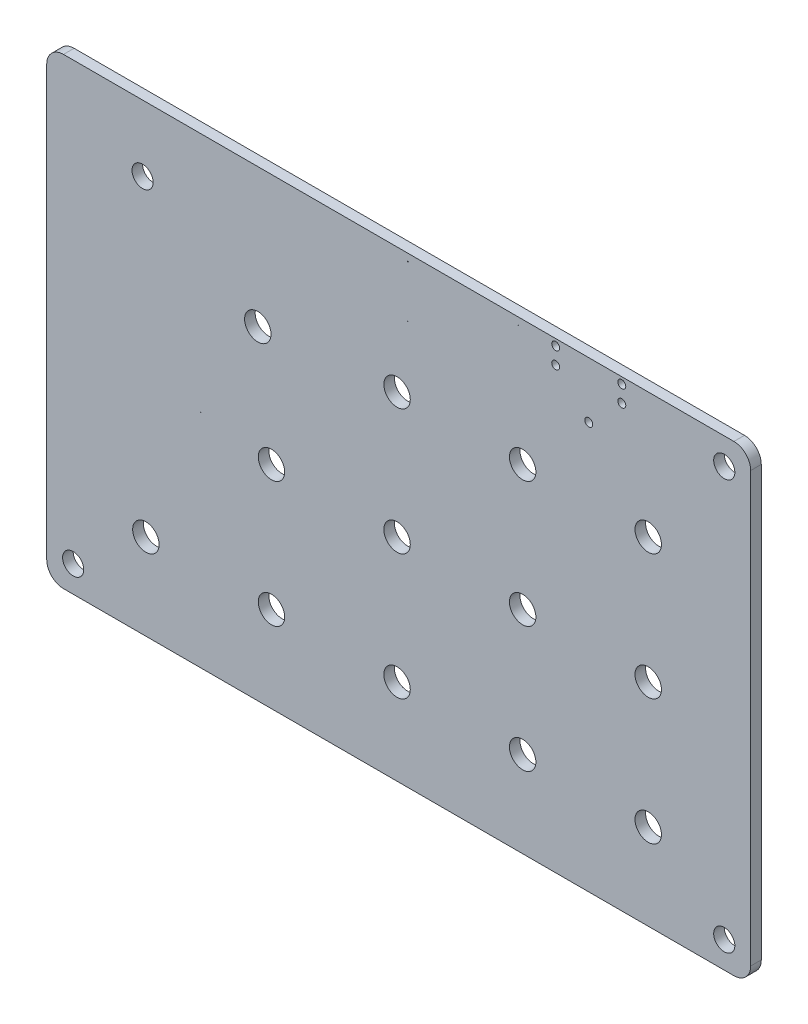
ISO-10303-21;
HEADER;
FILE_DESCRIPTION(('STEP AP214'),'2;1');
FILE_NAME('part.step','',(''),(''),'','','');
FILE_SCHEMA(('AUTOMOTIVE_DESIGN { 1 0 10303 214 1 1 1 1 }'));
ENDSEC;
DATA;
#1=APPLICATION_CONTEXT('core data for automotive mechanical design processes');
#2=APPLICATION_PROTOCOL_DEFINITION('international standard','automotive_design',2000,#1);
#3=PRODUCT_CONTEXT('',#1,'mechanical');
#4=PRODUCT('Part','Part','',(#3));
#5=PRODUCT_RELATED_PRODUCT_CATEGORY('part','',(#4));
#6=PRODUCT_DEFINITION_FORMATION('','',#4);
#7=PRODUCT_DEFINITION_CONTEXT('part definition',#1,'design');
#8=PRODUCT_DEFINITION('design','',#6,#7);
#9=PRODUCT_DEFINITION_SHAPE('','',#8);
#10=(LENGTH_UNIT() NAMED_UNIT(*) SI_UNIT(.MILLI.,.METRE.));
#11=(NAMED_UNIT(*) PLANE_ANGLE_UNIT() SI_UNIT($,.RADIAN.));
#12=(NAMED_UNIT(*) SI_UNIT($,.STERADIAN.) SOLID_ANGLE_UNIT());
#13=UNCERTAINTY_MEASURE_WITH_UNIT(LENGTH_MEASURE(1.E-05),#10,'distance_accuracy_value','');
#14=(GEOMETRIC_REPRESENTATION_CONTEXT(3) GLOBAL_UNCERTAINTY_ASSIGNED_CONTEXT((#13)) GLOBAL_UNIT_ASSIGNED_CONTEXT((#10,
#11,#12)) REPRESENTATION_CONTEXT('',''));
#15=CARTESIAN_POINT('',(0.,0.,0.));
#16=DIRECTION('',(0.,0.,1.));
#17=DIRECTION('',(1.,0.,0.));
#18=AXIS2_PLACEMENT_3D('',#15,#16,#17);
#19=CARTESIAN_POINT('',(0.,70.,1.6));
#20=DIRECTION('',(0.,-1.,0.));
#21=DIRECTION('',(0.,0.,-1.));
#22=AXIS2_PLACEMENT_3D('',#19,#20,#21);
#23=PLANE('',#22);
#24=DIRECTION('',(-1.,0.,0.));
#25=VECTOR('',#24,1.);
#26=CARTESIAN_POINT('',(0.,70.,0.));
#27=LINE('',#26,#25);
#28=CARTESIAN_POINT('',(103.96,70.,0.));
#29=VERTEX_POINT('',#28);
#30=CARTESIAN_POINT('',(2.54,70.,0.));
#31=VERTEX_POINT('',#30);
#32=EDGE_CURVE('E369',#29,#31,#27,.T.);
#33=ORIENTED_EDGE('',*,*,#32,.T.);
#34=DIRECTION('',(0.,0.,-1.));
#35=VECTOR('',#34,1.);
#36=CARTESIAN_POINT('',(2.54,70.,1.6));
#37=LINE('',#36,#35);
#38=CARTESIAN_POINT('',(2.54,70.,1.6));
#39=VERTEX_POINT('',#38);
#40=EDGE_CURVE('E11',#39,#31,#37,.T.);
#41=ORIENTED_EDGE('',*,*,#40,.F.);
#42=DIRECTION('',(-1.,0.,0.));
#43=VECTOR('',#42,1.);
#44=CARTESIAN_POINT('',(0.,70.,1.6));
#45=LINE('',#44,#43);
#46=CARTESIAN_POINT('',(103.96,70.,1.6));
#47=VERTEX_POINT('',#46);
#48=EDGE_CURVE('E709',#47,#39,#45,.T.);
#49=ORIENTED_EDGE('',*,*,#48,.F.);
#50=DIRECTION('',(0.,0.,-1.));
#51=VECTOR('',#50,1.);
#52=CARTESIAN_POINT('',(103.96,70.,1.6));
#53=LINE('',#52,#51);
#54=EDGE_CURVE('E387',#47,#29,#53,.T.);
#55=ORIENTED_EDGE('',*,*,#54,.T.);
#56=EDGE_LOOP('',(#33,#41,#49,#55));
#57=FACE_BOUND('',#56,.T.);
#58=ADVANCED_FACE('F33',(#57),#23,.F.);
#59=CARTESIAN_POINT('',(2.54,67.46,1.6));
#60=DIRECTION('',(0.,0.,-1.));
#61=DIRECTION('',(-1.,0.,0.));
#62=AXIS2_PLACEMENT_3D('',#59,#60,#61);
#63=CYLINDRICAL_SURFACE('',#62,2.54000000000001);
#64=CARTESIAN_POINT('',(2.54,67.46,0.));
#65=DIRECTION('',(0.,0.,1.));
#66=DIRECTION('',(1.,0.,0.));
#67=AXIS2_PLACEMENT_3D('',#64,#65,#66);
#68=CIRCLE('',#67,2.54000000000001);
#69=CARTESIAN_POINT('',(0.,67.46,0.));
#70=VERTEX_POINT('',#69);
#71=EDGE_CURVE('E372',#31,#70,#68,.T.);
#72=ORIENTED_EDGE('',*,*,#71,.T.);
#73=DIRECTION('',(0.,0.,-1.));
#74=VECTOR('',#73,1.);
#75=CARTESIAN_POINT('',(0.,67.46,1.6));
#76=LINE('',#75,#74);
#77=CARTESIAN_POINT('',(0.,67.46,1.6));
#78=VERTEX_POINT('',#77);
#79=EDGE_CURVE('E43',#78,#70,#76,.T.);
#80=ORIENTED_EDGE('',*,*,#79,.F.);
#81=CARTESIAN_POINT('',(2.54,67.46,1.6));
#82=DIRECTION('',(0.,0.,1.));
#83=DIRECTION('',(1.,0.,0.));
#84=AXIS2_PLACEMENT_3D('',#81,#82,#83);
#85=CIRCLE('',#84,2.54000000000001);
#86=EDGE_CURVE('E711',#39,#78,#85,.T.);
#87=ORIENTED_EDGE('',*,*,#86,.F.);
#88=ORIENTED_EDGE('',*,*,#40,.T.);
#89=EDGE_LOOP('',(#72,#80,#87,#88));
#90=FACE_BOUND('',#89,.T.);
#91=ADVANCED_FACE('F469',(#90),#63,.T.);
#92=CARTESIAN_POINT('',(0.,0.,1.6));
#93=DIRECTION('',(1.,0.,0.));
#94=DIRECTION('',(0.,0.,-1.));
#95=AXIS2_PLACEMENT_3D('',#92,#93,#94);
#96=PLANE('',#95);
#97=DIRECTION('',(0.,-1.,0.));
#98=VECTOR('',#97,1.);
#99=CARTESIAN_POINT('',(0.,0.,0.));
#100=LINE('',#99,#98);
#101=CARTESIAN_POINT('',(0.,2.54,0.));
#102=VERTEX_POINT('',#101);
#103=EDGE_CURVE('E374',#70,#102,#100,.T.);
#104=ORIENTED_EDGE('',*,*,#103,.T.);
#105=DIRECTION('',(0.,0.,-1.));
#106=VECTOR('',#105,1.);
#107=CARTESIAN_POINT('',(0.,2.54,1.6));
#108=LINE('',#107,#106);
#109=CARTESIAN_POINT('',(0.,2.54,1.6));
#110=VERTEX_POINT('',#109);
#111=EDGE_CURVE('E395',#110,#102,#108,.T.);
#112=ORIENTED_EDGE('',*,*,#111,.F.);
#113=DIRECTION('',(0.,-1.,0.));
#114=VECTOR('',#113,1.);
#115=CARTESIAN_POINT('',(0.,0.,1.6));
#116=LINE('',#115,#114);
#117=EDGE_CURVE('E713',#78,#110,#116,.T.);
#118=ORIENTED_EDGE('',*,*,#117,.F.);
#119=ORIENTED_EDGE('',*,*,#79,.T.);
#120=EDGE_LOOP('',(#104,#112,#118,#119));
#121=FACE_BOUND('',#120,.T.);
#122=ADVANCED_FACE('F475',(#121),#96,.F.);
#123=CARTESIAN_POINT('',(2.54,2.54,1.6));
#124=DIRECTION('',(0.,0.,-1.));
#125=DIRECTION('',(-1.,0.,0.));
#126=AXIS2_PLACEMENT_3D('',#123,#124,#125);
#127=CYLINDRICAL_SURFACE('',#126,2.54);
#128=CARTESIAN_POINT('',(2.54,2.54,0.));
#129=DIRECTION('',(0.,0.,1.));
#130=DIRECTION('',(1.,0.,0.));
#131=AXIS2_PLACEMENT_3D('',#128,#129,#130);
#132=CIRCLE('',#131,2.54);
#133=CARTESIAN_POINT('',(2.54,0.,0.));
#134=VERTEX_POINT('',#133);
#135=EDGE_CURVE('E376',#102,#134,#132,.T.);
#136=ORIENTED_EDGE('',*,*,#135,.T.);
#137=DIRECTION('',(0.,0.,-1.));
#138=VECTOR('',#137,1.);
#139=CARTESIAN_POINT('',(2.54,0.,1.6));
#140=LINE('',#139,#138);
#141=CARTESIAN_POINT('',(2.54,0.,1.6));
#142=VERTEX_POINT('',#141);
#143=EDGE_CURVE('E392',#142,#134,#140,.T.);
#144=ORIENTED_EDGE('',*,*,#143,.F.);
#145=CARTESIAN_POINT('',(2.54,2.54,1.6));
#146=DIRECTION('',(0.,0.,1.));
#147=DIRECTION('',(1.,0.,0.));
#148=AXIS2_PLACEMENT_3D('',#145,#146,#147);
#149=CIRCLE('',#148,2.54);
#150=EDGE_CURVE('E715',#110,#142,#149,.T.);
#151=ORIENTED_EDGE('',*,*,#150,.F.);
#152=ORIENTED_EDGE('',*,*,#111,.T.);
#153=EDGE_LOOP('',(#136,#144,#151,#152));
#154=FACE_BOUND('',#153,.T.);
#155=ADVANCED_FACE('F721',(#154),#127,.T.);
#156=CARTESIAN_POINT('',(0.,0.,1.6));
#157=DIRECTION('',(0.,1.,0.));
#158=DIRECTION('',(0.,0.,1.));
#159=AXIS2_PLACEMENT_3D('',#156,#157,#158);
#160=PLANE('',#159);
#161=DIRECTION('',(1.,0.,0.));
#162=VECTOR('',#161,1.);
#163=CARTESIAN_POINT('',(0.,0.,0.));
#164=LINE('',#163,#162);
#165=CARTESIAN_POINT('',(103.96,0.,0.));
#166=VERTEX_POINT('',#165);
#167=EDGE_CURVE('E378',#134,#166,#164,.T.);
#168=ORIENTED_EDGE('',*,*,#167,.T.);
#169=DIRECTION('',(0.,0.,-1.));
#170=VECTOR('',#169,1.);
#171=CARTESIAN_POINT('',(103.96,0.,1.6));
#172=LINE('',#171,#170);
#173=CARTESIAN_POINT('',(103.96,0.,1.6));
#174=VERTEX_POINT('',#173);
#175=EDGE_CURVE('E245',#174,#166,#172,.T.);
#176=ORIENTED_EDGE('',*,*,#175,.F.);
#177=DIRECTION('',(1.,0.,0.));
#178=VECTOR('',#177,1.);
#179=CARTESIAN_POINT('',(0.,0.,1.6));
#180=LINE('',#179,#178);
#181=EDGE_CURVE('E236',#142,#174,#180,.T.);
#182=ORIENTED_EDGE('',*,*,#181,.F.);
#183=ORIENTED_EDGE('',*,*,#143,.T.);
#184=EDGE_LOOP('',(#168,#176,#182,#183));
#185=FACE_BOUND('',#184,.T.);
#186=ADVANCED_FACE('F725',(#185),#160,.F.);
#187=CARTESIAN_POINT('',(103.96,2.54,1.6));
#188=DIRECTION('',(0.,0.,-1.));
#189=DIRECTION('',(-1.,0.,0.));
#190=AXIS2_PLACEMENT_3D('',#187,#188,#189);
#191=CYLINDRICAL_SURFACE('',#190,2.54);
#192=CARTESIAN_POINT('',(103.96,2.54,0.));
#193=DIRECTION('',(0.,0.,1.));
#194=DIRECTION('',(1.,0.,0.));
#195=AXIS2_PLACEMENT_3D('',#192,#193,#194);
#196=CIRCLE('',#195,2.54);
#197=CARTESIAN_POINT('',(106.5,2.54,0.));
#198=VERTEX_POINT('',#197);
#199=EDGE_CURVE('E244',#166,#198,#196,.T.);
#200=ORIENTED_EDGE('',*,*,#199,.T.);
#201=DIRECTION('',(0.,0.,-1.));
#202=VECTOR('',#201,1.);
#203=CARTESIAN_POINT('',(106.5,2.54,1.6));
#204=LINE('',#203,#202);
#205=CARTESIAN_POINT('',(106.5,2.54,1.6));
#206=VERTEX_POINT('',#205);
#207=EDGE_CURVE('E241',#206,#198,#204,.T.);
#208=ORIENTED_EDGE('',*,*,#207,.F.);
#209=CARTESIAN_POINT('',(103.96,2.54,1.6));
#210=DIRECTION('',(0.,0.,1.));
#211=DIRECTION('',(1.,0.,0.));
#212=AXIS2_PLACEMENT_3D('',#209,#210,#211);
#213=CIRCLE('',#212,2.54);
#214=EDGE_CURVE('E229',#174,#206,#213,.T.);
#215=ORIENTED_EDGE('',*,*,#214,.F.);
#216=ORIENTED_EDGE('',*,*,#175,.T.);
#217=EDGE_LOOP('',(#200,#208,#215,#216));
#218=FACE_BOUND('',#217,.T.);
#219=ADVANCED_FACE('F242',(#218),#191,.T.);
#220=CARTESIAN_POINT('',(106.5,0.,1.6));
#221=DIRECTION('',(-1.,0.,0.));
#222=DIRECTION('',(0.,0.,1.));
#223=AXIS2_PLACEMENT_3D('',#220,#221,#222);
#224=PLANE('',#223);
#225=DIRECTION('',(0.,1.,0.));
#226=VECTOR('',#225,1.);
#227=CARTESIAN_POINT('',(106.5,0.,0.));
#228=LINE('',#227,#226);
#229=CARTESIAN_POINT('',(106.5,67.46,0.));
#230=VERTEX_POINT('',#229);
#231=EDGE_CURVE('E141',#198,#230,#228,.T.);
#232=ORIENTED_EDGE('',*,*,#231,.T.);
#233=DIRECTION('',(0.,0.,-1.));
#234=VECTOR('',#233,1.);
#235=CARTESIAN_POINT('',(106.5,67.46,1.6));
#236=LINE('',#235,#234);
#237=CARTESIAN_POINT('',(106.5,67.46,1.6));
#238=VERTEX_POINT('',#237);
#239=EDGE_CURVE('E246',#238,#230,#236,.T.);
#240=ORIENTED_EDGE('',*,*,#239,.F.);
#241=DIRECTION('',(0.,1.,0.));
#242=VECTOR('',#241,1.);
#243=CARTESIAN_POINT('',(106.5,0.,1.6));
#244=LINE('',#243,#242);
#245=EDGE_CURVE('E234',#206,#238,#244,.T.);
#246=ORIENTED_EDGE('',*,*,#245,.F.);
#247=ORIENTED_EDGE('',*,*,#207,.T.);
#248=EDGE_LOOP('',(#232,#240,#246,#247));
#249=FACE_BOUND('',#248,.T.);
#250=ADVANCED_FACE('F248',(#249),#224,.F.);
#251=CARTESIAN_POINT('',(0.,68.8985,1.6));
#252=DIRECTION('',(0.,-1.,0.));
#253=DIRECTION('',(0.,0.,-1.));
#254=AXIS2_PLACEMENT_3D('',#251,#252,#253);
#255=PLANE('',#254);
#256=DIRECTION('',(-1.,0.,0.));
#257=VECTOR('',#256,1.);
#258=CARTESIAN_POINT('',(0.,68.8985,0.));
#259=LINE('',#258,#257);
#260=CARTESIAN_POINT('',(71.35,68.8985,0.));
#261=VERTEX_POINT('',#260);
#262=CARTESIAN_POINT('',(71.2992,68.8985,0.));
#263=VERTEX_POINT('',#262);
#264=EDGE_CURVE('E263',#261,#263,#259,.T.);
#265=ORIENTED_EDGE('',*,*,#264,.T.);
#266=DIRECTION('',(0.,0.,-1.));
#267=VECTOR('',#266,1.);
#268=CARTESIAN_POINT('',(71.2992,68.8985,1.6));
#269=LINE('',#268,#267);
#270=CARTESIAN_POINT('',(71.2992,68.8985,1.6));
#271=VERTEX_POINT('',#270);
#272=EDGE_CURVE('E389',#271,#263,#269,.T.);
#273=ORIENTED_EDGE('',*,*,#272,.F.);
#274=DIRECTION('',(-1.,0.,0.));
#275=VECTOR('',#274,1.);
#276=CARTESIAN_POINT('',(0.,68.8985,1.6));
#277=LINE('',#276,#275);
#278=CARTESIAN_POINT('',(71.35,68.8985,1.6));
#279=VERTEX_POINT('',#278);
#280=EDGE_CURVE('E650',#279,#271,#277,.T.);
#281=ORIENTED_EDGE('',*,*,#280,.F.);
#282=DIRECTION('',(0.,0.,-1.));
#283=VECTOR('',#282,1.);
#284=CARTESIAN_POINT('',(71.35,68.8985,1.6));
#285=LINE('',#284,#283);
#286=EDGE_CURVE('E400',#279,#261,#285,.T.);
#287=ORIENTED_EDGE('',*,*,#286,.T.);
#288=EDGE_LOOP('',(#265,#273,#281,#287));
#289=FACE_BOUND('',#288,.T.);
#290=ADVANCED_FACE('F563',(#289),#255,.F.);
#291=CARTESIAN_POINT('',(71.35,68.8985,1.6));
#292=DIRECTION('',(0.,0.,-1.));
#293=DIRECTION('',(-1.,0.,0.));
#294=AXIS2_PLACEMENT_3D('',#291,#292,#293);
#295=CYLINDRICAL_SURFACE('',#294,0.0507999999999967);
#296=CARTESIAN_POINT('',(71.35,68.8985,0.));
#297=DIRECTION('',(0.,0.,1.));
#298=DIRECTION('',(1.,0.,0.));
#299=AXIS2_PLACEMENT_3D('',#296,#297,#298);
#300=CIRCLE('',#299,0.0507999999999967);
#301=CARTESIAN_POINT('',(71.35,68.8477,0.));
#302=VERTEX_POINT('',#301);
#303=EDGE_CURVE('E312',#302,#263,#300,.T.);
#304=ORIENTED_EDGE('',*,*,#303,.F.);
#305=DIRECTION('',(0.,0.,-1.));
#306=VECTOR('',#305,1.);
#307=CARTESIAN_POINT('',(71.35,68.8477,1.6));
#308=LINE('',#307,#306);
#309=CARTESIAN_POINT('',(71.35,68.8477,1.6));
#310=VERTEX_POINT('',#309);
#311=EDGE_CURVE('E402',#310,#302,#308,.T.);
#312=ORIENTED_EDGE('',*,*,#311,.F.);
#313=CARTESIAN_POINT('',(71.35,68.8985,1.6));
#314=DIRECTION('',(0.,0.,1.));
#315=DIRECTION('',(1.,0.,0.));
#316=AXIS2_PLACEMENT_3D('',#313,#314,#315);
#317=CIRCLE('',#316,0.0507999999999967);
#318=EDGE_CURVE('E651',#310,#271,#317,.T.);
#319=ORIENTED_EDGE('',*,*,#318,.T.);
#320=ORIENTED_EDGE('',*,*,#272,.T.);
#321=EDGE_LOOP('',(#304,#312,#319,#320));
#322=FACE_BOUND('',#321,.T.);
#323=ADVANCED_FACE('F559',(#322),#295,.F.);
#324=CARTESIAN_POINT('',(5.5,33.48005,1.6));
#325=DIRECTION('',(0.,0.,-1.));
#326=DIRECTION('',(-1.,0.,0.));
#327=AXIS2_PLACEMENT_3D('',#324,#325,#326);
#328=CYLINDRICAL_SURFACE('',#327,0.0317499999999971);
#329=CARTESIAN_POINT('',(5.5,33.48005,0.));
#330=DIRECTION('',(0.,0.,1.));
#331=DIRECTION('',(1.,0.,0.));
#332=AXIS2_PLACEMENT_3D('',#329,#330,#331);
#333=CIRCLE('',#332,0.0317499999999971);
#334=CARTESIAN_POINT('',(5.5,33.5118,0.));
#335=VERTEX_POINT('',#334);
#336=CARTESIAN_POINT('',(5.5,33.4483,0.));
#337=VERTEX_POINT('',#336);
#338=EDGE_CURVE('E293',#335,#337,#333,.T.);
#339=ORIENTED_EDGE('',*,*,#338,.F.);
#340=DIRECTION('',(0.,0.,-1.));
#341=VECTOR('',#340,1.);
#342=CARTESIAN_POINT('',(5.5,33.5118,1.6));
#343=LINE('',#342,#341);
#344=CARTESIAN_POINT('',(5.5,33.5118,1.6));
#345=VERTEX_POINT('',#344);
#346=EDGE_CURVE('E403',#345,#335,#343,.T.);
#347=ORIENTED_EDGE('',*,*,#346,.F.);
#348=CARTESIAN_POINT('',(5.5,33.48005,1.6));
#349=DIRECTION('',(0.,0.,1.));
#350=DIRECTION('',(1.,0.,0.));
#351=AXIS2_PLACEMENT_3D('',#348,#349,#350);
#352=CIRCLE('',#351,0.0317499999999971);
#353=CARTESIAN_POINT('',(5.5,33.4483,1.6));
#354=VERTEX_POINT('',#353);
#355=EDGE_CURVE('E631',#345,#354,#352,.T.);
#356=ORIENTED_EDGE('',*,*,#355,.T.);
#357=DIRECTION('',(0.,0.,-1.));
#358=VECTOR('',#357,1.);
#359=CARTESIAN_POINT('',(5.5,33.4483,1.6));
#360=LINE('',#359,#358);
#361=EDGE_CURVE('E406',#354,#337,#360,.T.);
#362=ORIENTED_EDGE('',*,*,#361,.T.);
#363=EDGE_LOOP('',(#339,#347,#356,#362));
#364=FACE_BOUND('',#363,.T.);
#365=ADVANCED_FACE('F562',(#364),#328,.F.);
#366=CARTESIAN_POINT('',(5.5,0.,1.6));
#367=DIRECTION('',(-1.,0.,0.));
#368=DIRECTION('',(0.,0.,1.));
#369=AXIS2_PLACEMENT_3D('',#366,#367,#368);
#370=PLANE('',#369);
#371=DIRECTION('',(0.,1.,0.));
#372=VECTOR('',#371,1.);
#373=CARTESIAN_POINT('',(5.5,0.,0.));
#374=LINE('',#373,#372);
#375=CARTESIAN_POINT('',(5.5,33.48,0.));
#376=VERTEX_POINT('',#375);
#377=EDGE_CURVE('E297',#376,#335,#374,.T.);
#378=ORIENTED_EDGE('',*,*,#377,.F.);
#379=DIRECTION('',(0.,0.,-1.));
#380=VECTOR('',#379,1.);
#381=CARTESIAN_POINT('',(5.5,33.48,1.6));
#382=LINE('',#381,#380);
#383=CARTESIAN_POINT('',(5.5,33.48,1.6));
#384=VERTEX_POINT('',#383);
#385=EDGE_CURVE('E411',#384,#376,#382,.T.);
#386=ORIENTED_EDGE('',*,*,#385,.F.);
#387=DIRECTION('',(0.,1.,0.));
#388=VECTOR('',#387,1.);
#389=CARTESIAN_POINT('',(5.5,0.,1.6));
#390=LINE('',#389,#388);
#391=EDGE_CURVE('E635',#384,#345,#390,.T.);
#392=ORIENTED_EDGE('',*,*,#391,.T.);
#393=ORIENTED_EDGE('',*,*,#346,.T.);
#394=EDGE_LOOP('',(#378,#386,#392,#393));
#395=FACE_BOUND('',#394,.T.);
#396=ADVANCED_FACE('F587',(#395),#370,.T.);
#397=CARTESIAN_POINT('',(0.,33.48,1.6));
#398=DIRECTION('',(0.,-1.,0.));
#399=DIRECTION('',(0.,0.,-1.));
#400=AXIS2_PLACEMENT_3D('',#397,#398,#399);
#401=PLANE('',#400);
#402=DIRECTION('',(-1.,0.,0.));
#403=VECTOR('',#402,1.);
#404=CARTESIAN_POINT('',(0.,33.48,0.));
#405=LINE('',#404,#403);
#406=CARTESIAN_POINT('',(5.5317,33.48,0.));
#407=VERTEX_POINT('',#406);
#408=EDGE_CURVE('E294',#407,#376,#405,.T.);
#409=ORIENTED_EDGE('',*,*,#408,.F.);
#410=DIRECTION('',(0.,0.,-1.));
#411=VECTOR('',#410,1.);
#412=CARTESIAN_POINT('',(5.5317,33.48,1.6));
#413=LINE('',#412,#411);
#414=CARTESIAN_POINT('',(5.5317,33.48,1.6));
#415=VERTEX_POINT('',#414);
#416=EDGE_CURVE('E408',#415,#407,#413,.T.);
#417=ORIENTED_EDGE('',*,*,#416,.F.);
#418=DIRECTION('',(-1.,0.,0.));
#419=VECTOR('',#418,1.);
#420=CARTESIAN_POINT('',(0.,33.48,1.6));
#421=LINE('',#420,#419);
#422=EDGE_CURVE('E632',#415,#384,#421,.T.);
#423=ORIENTED_EDGE('',*,*,#422,.T.);
#424=ORIENTED_EDGE('',*,*,#385,.T.);
#425=EDGE_LOOP('',(#409,#417,#423,#424));
#426=FACE_BOUND('',#425,.T.);
#427=ADVANCED_FACE('F583',(#426),#401,.T.);
#428=CARTESIAN_POINT('',(23.28,0.,1.6));
#429=DIRECTION('',(1.,0.,0.));
#430=DIRECTION('',(0.,1.,0.));
#431=AXIS2_PLACEMENT_3D('',#428,#429,#430);
#432=PLANE('',#431);
#433=DIRECTION('',(0.,-1.,0.));
#434=VECTOR('',#433,1.);
#435=CARTESIAN_POINT('',(23.28,0.,0.));
#436=LINE('',#435,#434);
#437=CARTESIAN_POINT('',(23.28,33.5118,0.));
#438=VERTEX_POINT('',#437);
#439=CARTESIAN_POINT('',(23.28,33.48,0.));
#440=VERTEX_POINT('',#439);
#441=EDGE_CURVE('E281',#438,#440,#436,.T.);
#442=ORIENTED_EDGE('',*,*,#441,.F.);
#443=DIRECTION('',(0.,0.,-1.));
#444=VECTOR('',#443,1.);
#445=CARTESIAN_POINT('',(23.28,33.5118,1.6));
#446=LINE('',#445,#444);
#447=CARTESIAN_POINT('',(23.28,33.5118,1.6));
#448=VERTEX_POINT('',#447);
#449=EDGE_CURVE('E409',#448,#438,#446,.T.);
#450=ORIENTED_EDGE('',*,*,#449,.F.);
#451=DIRECTION('',(0.,-1.,0.));
#452=VECTOR('',#451,1.);
#453=CARTESIAN_POINT('',(23.28,0.,1.6));
#454=LINE('',#453,#452);
#455=CARTESIAN_POINT('',(23.28,33.48,1.6));
#456=VERTEX_POINT('',#455);
#457=EDGE_CURVE('E621',#448,#456,#454,.T.);
#458=ORIENTED_EDGE('',*,*,#457,.T.);
#459=DIRECTION('',(0.,0.,-1.));
#460=VECTOR('',#459,1.);
#461=CARTESIAN_POINT('',(23.28,33.48,1.6));
#462=LINE('',#461,#460);
#463=EDGE_CURVE('E414',#456,#440,#462,.T.);
#464=ORIENTED_EDGE('',*,*,#463,.T.);
#465=EDGE_LOOP('',(#442,#450,#458,#464));
#466=FACE_BOUND('',#465,.T.);
#467=ADVANCED_FACE('F586',(#466),#432,.T.);
#468=CARTESIAN_POINT('',(23.28,33.48005,1.6));
#469=DIRECTION('',(0.,0.,-1.));
#470=DIRECTION('',(-1.,0.,0.));
#471=AXIS2_PLACEMENT_3D('',#468,#469,#470);
#472=CYLINDRICAL_SURFACE('',#471,0.0317499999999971);
#473=CARTESIAN_POINT('',(23.28,33.48005,0.));
#474=DIRECTION('',(0.,0.,1.));
#475=DIRECTION('',(1.,0.,0.));
#476=AXIS2_PLACEMENT_3D('',#473,#474,#475);
#477=CIRCLE('',#476,0.0317499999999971);
#478=CARTESIAN_POINT('',(23.2799999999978,33.4483,0.));
#479=VERTEX_POINT('',#478);
#480=EDGE_CURVE('E284',#479,#438,#477,.T.);
#481=ORIENTED_EDGE('',*,*,#480,.F.);
#482=DIRECTION('',(0.,0.,-1.));
#483=VECTOR('',#482,1.);
#484=CARTESIAN_POINT('',(23.2799999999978,33.4483,1.6));
#485=LINE('',#484,#483);
#486=CARTESIAN_POINT('',(23.2799999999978,33.4483,1.6));
#487=VERTEX_POINT('',#486);
#488=EDGE_CURVE('E419',#487,#479,#485,.T.);
#489=ORIENTED_EDGE('',*,*,#488,.F.);
#490=CARTESIAN_POINT('',(23.28,33.48005,1.6));
#491=DIRECTION('',(0.,0.,1.));
#492=DIRECTION('',(1.,0.,0.));
#493=AXIS2_PLACEMENT_3D('',#490,#491,#492);
#494=CIRCLE('',#493,0.0317499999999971);
#495=EDGE_CURVE('E616',#487,#448,#494,.T.);
#496=ORIENTED_EDGE('',*,*,#495,.T.);
#497=ORIENTED_EDGE('',*,*,#449,.T.);
#498=EDGE_LOOP('',(#481,#489,#496,#497));
#499=FACE_BOUND('',#498,.T.);
#500=ADVANCED_FACE('F598',(#499),#472,.F.);
#501=CARTESIAN_POINT('',(23.28,33.48,1.6));
#502=DIRECTION('',(0.,0.,-1.));
#503=DIRECTION('',(-1.,0.,0.));
#504=AXIS2_PLACEMENT_3D('',#501,#502,#503);
#505=CYLINDRICAL_SURFACE('',#504,0.0316999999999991);
#506=CARTESIAN_POINT('',(23.28,33.48,0.));
#507=DIRECTION('',(0.,0.,1.));
#508=DIRECTION('',(1.,0.,0.));
#509=AXIS2_PLACEMENT_3D('',#506,#507,#508);
#510=CIRCLE('',#509,0.0316999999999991);
#511=CARTESIAN_POINT('',(23.2483,33.48,0.));
#512=VERTEX_POINT('',#511);
#513=EDGE_CURVE('E287',#512,#479,#510,.T.);
#514=ORIENTED_EDGE('',*,*,#513,.F.);
#515=DIRECTION('',(0.,0.,-1.));
#516=VECTOR('',#515,1.);
#517=CARTESIAN_POINT('',(23.2483,33.48,1.6));
#518=LINE('',#517,#516);
#519=CARTESIAN_POINT('',(23.2483,33.48,1.6));
#520=VERTEX_POINT('',#519);
#521=EDGE_CURVE('E416',#520,#512,#518,.T.);
#522=ORIENTED_EDGE('',*,*,#521,.F.);
#523=CARTESIAN_POINT('',(23.28,33.48,1.6));
#524=DIRECTION('',(0.,0.,1.));
#525=DIRECTION('',(1.,0.,0.));
#526=AXIS2_PLACEMENT_3D('',#523,#524,#525);
#527=CIRCLE('',#526,0.0316999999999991);
#528=EDGE_CURVE('E620',#520,#487,#527,.T.);
#529=ORIENTED_EDGE('',*,*,#528,.T.);
#530=ORIENTED_EDGE('',*,*,#488,.T.);
#531=EDGE_LOOP('',(#514,#522,#529,#530));
#532=FACE_BOUND('',#531,.T.);
#533=ADVANCED_FACE('F595',(#532),#505,.F.);
#534=CARTESIAN_POINT('',(0.,61.1,1.6));
#535=DIRECTION('',(0.,-1.,0.));
#536=DIRECTION('',(0.,0.,-1.));
#537=AXIS2_PLACEMENT_3D('',#534,#535,#536);
#538=PLANE('',#537);
#539=DIRECTION('',(-1.,0.,0.));
#540=VECTOR('',#539,1.);
#541=CARTESIAN_POINT('',(0.,61.1,0.));
#542=LINE('',#541,#540);
#543=CARTESIAN_POINT('',(54.7008,61.1,0.));
#544=VERTEX_POINT('',#543);
#545=CARTESIAN_POINT('',(54.65,61.1,0.));
#546=VERTEX_POINT('',#545);
#547=EDGE_CURVE('E277',#544,#546,#542,.T.);
#548=ORIENTED_EDGE('',*,*,#547,.F.);
#549=DIRECTION('',(0.,0.,-1.));
#550=VECTOR('',#549,1.);
#551=CARTESIAN_POINT('',(54.7008,61.1,1.6));
#552=LINE('',#551,#550);
#553=CARTESIAN_POINT('',(54.7008,61.1,1.6));
#554=VERTEX_POINT('',#553);
#555=EDGE_CURVE('E417',#554,#544,#552,.T.);
#556=ORIENTED_EDGE('',*,*,#555,.F.);
#557=DIRECTION('',(-1.,0.,0.));
#558=VECTOR('',#557,1.);
#559=CARTESIAN_POINT('',(0.,61.1,1.6));
#560=LINE('',#559,#558);
#561=CARTESIAN_POINT('',(54.65,61.1,1.6));
#562=VERTEX_POINT('',#561);
#563=EDGE_CURVE('E1070',#554,#562,#560,.T.);
#564=ORIENTED_EDGE('',*,*,#563,.T.);
#565=DIRECTION('',(0.,0.,-1.));
#566=VECTOR('',#565,1.);
#567=CARTESIAN_POINT('',(54.65,61.1,1.6));
#568=LINE('',#567,#566);
#569=EDGE_CURVE('E422',#562,#546,#568,.T.);
#570=ORIENTED_EDGE('',*,*,#569,.T.);
#571=EDGE_LOOP('',(#548,#556,#564,#570));
#572=FACE_BOUND('',#571,.T.);
#573=ADVANCED_FACE('F462',(#572),#538,.T.);
#574=CARTESIAN_POINT('',(54.65,61.1,1.6));
#575=DIRECTION('',(0.,0.,-1.));
#576=DIRECTION('',(-1.,0.,0.));
#577=AXIS2_PLACEMENT_3D('',#574,#575,#576);
#578=CYLINDRICAL_SURFACE('',#577,0.0507999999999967);
#579=CARTESIAN_POINT('',(54.65,61.1,0.));
#580=DIRECTION('',(0.,0.,1.));
#581=DIRECTION('',(1.,0.,0.));
#582=AXIS2_PLACEMENT_3D('',#579,#580,#581);
#583=CIRCLE('',#582,0.0507999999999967);
#584=CARTESIAN_POINT('',(54.65,61.1508,0.));
#585=VERTEX_POINT('',#584);
#586=EDGE_CURVE('E278',#585,#544,#583,.T.);
#587=ORIENTED_EDGE('',*,*,#586,.F.);
#588=DIRECTION('',(0.,0.,-1.));
#589=VECTOR('',#588,1.);
#590=CARTESIAN_POINT('',(54.65,61.1508,1.6));
#591=LINE('',#590,#589);
#592=CARTESIAN_POINT('',(54.65,61.1508,1.6));
#593=VERTEX_POINT('',#592);
#594=EDGE_CURVE('E424',#593,#585,#591,.T.);
#595=ORIENTED_EDGE('',*,*,#594,.F.);
#596=CARTESIAN_POINT('',(54.65,61.1,1.6));
#597=DIRECTION('',(0.,0.,1.));
#598=DIRECTION('',(1.,0.,0.));
#599=AXIS2_PLACEMENT_3D('',#596,#597,#598);
#600=CIRCLE('',#599,0.0507999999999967);
#601=EDGE_CURVE('E1191',#593,#554,#600,.T.);
#602=ORIENTED_EDGE('',*,*,#601,.T.);
#603=ORIENTED_EDGE('',*,*,#555,.T.);
#604=EDGE_LOOP('',(#587,#595,#602,#603));
#605=FACE_BOUND('',#604,.T.);
#606=ADVANCED_FACE('F814',(#605),#578,.F.);
#607=CARTESIAN_POINT('',(71.35,0.,1.6));
#608=DIRECTION('',(1.,0.,0.));
#609=DIRECTION('',(0.,0.,-1.));
#610=AXIS2_PLACEMENT_3D('',#607,#608,#609);
#611=PLANE('',#610);
#612=DIRECTION('',(0.,-1.,0.));
#613=VECTOR('',#612,1.);
#614=CARTESIAN_POINT('',(71.35,0.,0.));
#615=LINE('',#614,#613);
#616=CARTESIAN_POINT('',(71.35,61.1508,0.));
#617=VERTEX_POINT('',#616);
#618=CARTESIAN_POINT('',(71.35,61.1,0.));
#619=VERTEX_POINT('',#618);
#620=EDGE_CURVE('E266',#617,#619,#615,.T.);
#621=ORIENTED_EDGE('',*,*,#620,.F.);
#622=DIRECTION('',(0.,0.,-1.));
#623=VECTOR('',#622,1.);
#624=CARTESIAN_POINT('',(71.35,61.1508,1.6));
#625=LINE('',#624,#623);
#626=CARTESIAN_POINT('',(71.35,61.1508,1.6));
#627=VERTEX_POINT('',#626);
#628=EDGE_CURVE('E425',#627,#617,#625,.T.);
#629=ORIENTED_EDGE('',*,*,#628,.F.);
#630=DIRECTION('',(0.,-1.,0.));
#631=VECTOR('',#630,1.);
#632=CARTESIAN_POINT('',(71.35,0.,1.6));
#633=LINE('',#632,#631);
#634=CARTESIAN_POINT('',(71.35,61.1,1.6));
#635=VERTEX_POINT('',#634);
#636=EDGE_CURVE('E1065',#627,#635,#633,.T.);
#637=ORIENTED_EDGE('',*,*,#636,.T.);
#638=DIRECTION('',(0.,0.,-1.));
#639=VECTOR('',#638,1.);
#640=CARTESIAN_POINT('',(71.35,61.1,1.6));
#641=LINE('',#640,#639);
#642=EDGE_CURVE('E428',#635,#619,#641,.T.);
#643=ORIENTED_EDGE('',*,*,#642,.T.);
#644=EDGE_LOOP('',(#621,#629,#637,#643));
#645=FACE_BOUND('',#644,.T.);
#646=ADVANCED_FACE('F558',(#645),#611,.T.);
#647=CARTESIAN_POINT('',(71.35,61.1,1.6));
#648=DIRECTION('',(0.,0.,-1.));
#649=DIRECTION('',(-1.,0.,0.));
#650=AXIS2_PLACEMENT_3D('',#647,#648,#649);
#651=CYLINDRICAL_SURFACE('',#650,0.0508000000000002);
#652=CARTESIAN_POINT('',(71.35,61.1,0.));
#653=DIRECTION('',(0.,0.,1.));
#654=DIRECTION('',(1.,0.,0.));
#655=AXIS2_PLACEMENT_3D('',#652,#653,#654);
#656=CIRCLE('',#655,0.0508000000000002);
#657=CARTESIAN_POINT('',(71.2992,61.1,0.));
#658=VERTEX_POINT('',#657);
#659=EDGE_CURVE('E270',#658,#617,#656,.T.);
#660=ORIENTED_EDGE('',*,*,#659,.F.);
#661=DIRECTION('',(0.,0.,-1.));
#662=VECTOR('',#661,1.);
#663=CARTESIAN_POINT('',(71.2992,61.1,1.6));
#664=LINE('',#663,#662);
#665=CARTESIAN_POINT('',(71.2992,61.1,1.6));
#666=VERTEX_POINT('',#665);
#667=EDGE_CURVE('E430',#666,#658,#664,.T.);
#668=ORIENTED_EDGE('',*,*,#667,.F.);
#669=CARTESIAN_POINT('',(71.35,61.1,1.6));
#670=DIRECTION('',(0.,0.,1.));
#671=DIRECTION('',(1.,0.,0.));
#672=AXIS2_PLACEMENT_3D('',#669,#670,#671);
#673=CIRCLE('',#672,0.0508000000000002);
#674=EDGE_CURVE('E1188',#666,#627,#673,.T.);
#675=ORIENTED_EDGE('',*,*,#674,.T.);
#676=ORIENTED_EDGE('',*,*,#628,.T.);
#677=EDGE_LOOP('',(#660,#668,#675,#676));
#678=FACE_BOUND('',#677,.T.);
#679=ADVANCED_FACE('F832',(#678),#651,.F.);
#680=CARTESIAN_POINT('',(54.65,68.8985,1.6));
#681=DIRECTION('',(0.,0.,-1.));
#682=DIRECTION('',(-1.,0.,0.));
#683=AXIS2_PLACEMENT_3D('',#680,#681,#682);
#684=CYLINDRICAL_SURFACE('',#683,0.0507999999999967);
#685=CARTESIAN_POINT('',(54.65,68.8985,0.));
#686=DIRECTION('',(0.,0.,1.));
#687=DIRECTION('',(1.,0.,0.));
#688=AXIS2_PLACEMENT_3D('',#685,#686,#687);
#689=CIRCLE('',#688,0.0507999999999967);
#690=CARTESIAN_POINT('',(54.7008,68.8985,0.));
#691=VERTEX_POINT('',#690);
#692=CARTESIAN_POINT('',(54.65,68.8477,0.));
#693=VERTEX_POINT('',#692);
#694=EDGE_CURVE('E257',#691,#693,#689,.T.);
#695=ORIENTED_EDGE('',*,*,#694,.F.);
#696=DIRECTION('',(0.,0.,-1.));
#697=VECTOR('',#696,1.);
#698=CARTESIAN_POINT('',(54.7008,68.8985,1.6));
#699=LINE('',#698,#697);
#700=CARTESIAN_POINT('',(54.7008,68.8985,1.6));
#701=VERTEX_POINT('',#700);
#702=EDGE_CURVE('E37',#701,#691,#699,.T.);
#703=ORIENTED_EDGE('',*,*,#702,.F.);
#704=CARTESIAN_POINT('',(54.65,68.8985,1.6));
#705=DIRECTION('',(0.,0.,1.));
#706=DIRECTION('',(1.,0.,0.));
#707=AXIS2_PLACEMENT_3D('',#704,#705,#706);
#708=CIRCLE('',#707,0.0507999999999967);
#709=CARTESIAN_POINT('',(54.65,68.8477,1.6));
#710=VERTEX_POINT('',#709);
#711=EDGE_CURVE('E386',#701,#710,#708,.T.);
#712=ORIENTED_EDGE('',*,*,#711,.T.);
#713=DIRECTION('',(0.,0.,-1.));
#714=VECTOR('',#713,1.);
#715=CARTESIAN_POINT('',(54.65,68.8477,1.6));
#716=LINE('',#715,#714);
#717=EDGE_CURVE('E256',#710,#693,#716,.T.);
#718=ORIENTED_EDGE('',*,*,#717,.T.);
#719=EDGE_LOOP('',(#695,#703,#712,#718));
#720=FACE_BOUND('',#719,.T.);
#721=ADVANCED_FACE('F35',(#720),#684,.F.);
#722=CARTESIAN_POINT('',(54.65,68.8985,0.));
#723=VERTEX_POINT('',#722);
#724=EDGE_CURVE('E260',#691,#723,#259,.T.);
#725=ORIENTED_EDGE('',*,*,#724,.T.);
#726=DIRECTION('',(0.,0.,-1.));
#727=VECTOR('',#726,1.);
#728=CARTESIAN_POINT('',(54.65,68.8985,1.6));
#729=LINE('',#728,#727);
#730=CARTESIAN_POINT('',(54.65,68.8985,1.6));
#731=VERTEX_POINT('',#730);
#732=EDGE_CURVE('E433',#731,#723,#729,.T.);
#733=ORIENTED_EDGE('',*,*,#732,.F.);
#734=EDGE_CURVE('E442',#701,#731,#277,.T.);
#735=ORIENTED_EDGE('',*,*,#734,.F.);
#736=ORIENTED_EDGE('',*,*,#702,.T.);
#737=EDGE_LOOP('',(#725,#733,#735,#736));
#738=FACE_BOUND('',#737,.T.);
#739=ADVANCED_FACE('F441',(#738),#255,.F.);
#740=CARTESIAN_POINT('',(103.96,67.46,1.6));
#741=DIRECTION('',(0.,0.,-1.));
#742=DIRECTION('',(-1.,0.,0.));
#743=AXIS2_PLACEMENT_3D('',#740,#741,#742);
#744=CYLINDRICAL_SURFACE('',#743,2.54000000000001);
#745=CARTESIAN_POINT('',(103.96,67.46,0.));
#746=DIRECTION('',(0.,0.,1.));
#747=DIRECTION('',(1.,0.,0.));
#748=AXIS2_PLACEMENT_3D('',#745,#746,#747);
#749=CIRCLE('',#748,2.54000000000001);
#750=EDGE_CURVE('E147',#230,#29,#749,.T.);
#751=ORIENTED_EDGE('',*,*,#750,.T.);
#752=ORIENTED_EDGE('',*,*,#54,.F.);
#753=CARTESIAN_POINT('',(103.96,67.46,1.6));
#754=DIRECTION('',(0.,0.,1.));
#755=DIRECTION('',(1.,0.,0.));
#756=AXIS2_PLACEMENT_3D('',#753,#754,#755);
#757=CIRCLE('',#756,2.54000000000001);
#758=EDGE_CURVE('E52',#238,#47,#757,.T.);
#759=ORIENTED_EDGE('',*,*,#758,.F.);
#760=ORIENTED_EDGE('',*,*,#239,.T.);
#761=EDGE_LOOP('',(#751,#752,#759,#760));
#762=FACE_BOUND('',#761,.T.);
#763=ADVANCED_FACE('F484',(#762),#744,.T.);
#764=CARTESIAN_POINT('',(77.,66.525,1.6));
#765=DIRECTION('',(0.,0.,-1.));
#766=DIRECTION('',(-1.,0.,0.));
#767=AXIS2_PLACEMENT_3D('',#764,#765,#766);
#768=CYLINDRICAL_SURFACE('',#767,0.600000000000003);
#769=CARTESIAN_POINT('',(77.,66.525,1.6));
#770=DIRECTION('',(0.,0.,1.));
#771=DIRECTION('',(1.,0.,0.));
#772=AXIS2_PLACEMENT_3D('',#769,#770,#771);
#773=CIRCLE('',#772,0.600000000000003);
#774=CARTESIAN_POINT('',(77.6,66.525,1.6));
#775=VERTEX_POINT('',#774);
#776=EDGE_CURVE('E706',#775,#775,#773,.T.);
#777=ORIENTED_EDGE('',*,*,#776,.T.);
#778=EDGE_LOOP('',(#777));
#779=FACE_BOUND('',#778,.T.);
#780=CARTESIAN_POINT('',(77.,66.525,0.));
#781=DIRECTION('',(0.,0.,1.));
#782=DIRECTION('',(1.,0.,0.));
#783=AXIS2_PLACEMENT_3D('',#780,#781,#782);
#784=CIRCLE('',#783,0.600000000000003);
#785=CARTESIAN_POINT('',(77.6,66.525,0.));
#786=VERTEX_POINT('',#785);
#787=EDGE_CURVE('E366',#786,#786,#784,.T.);
#788=ORIENTED_EDGE('',*,*,#787,.F.);
#789=EDGE_LOOP('',(#788));
#790=FACE_BOUND('',#789,.T.);
#791=ADVANCED_FACE('F480',(#779,#790),#768,.F.);
#792=CARTESIAN_POINT('',(77.,69.025,1.6));
#793=DIRECTION('',(0.,0.,-1.));
#794=DIRECTION('',(-1.,0.,0.));
#795=AXIS2_PLACEMENT_3D('',#792,#793,#794);
#796=CYLINDRICAL_SURFACE('',#795,0.600000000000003);
#797=CARTESIAN_POINT('',(77.,69.025,1.6));
#798=DIRECTION('',(0.,0.,1.));
#799=DIRECTION('',(1.,0.,0.));
#800=AXIS2_PLACEMENT_3D('',#797,#798,#799);
#801=CIRCLE('',#800,0.600000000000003);
#802=CARTESIAN_POINT('',(77.6,69.025,1.6));
#803=VERTEX_POINT('',#802);
#804=EDGE_CURVE('E703',#803,#803,#801,.T.);
#805=ORIENTED_EDGE('',*,*,#804,.T.);
#806=EDGE_LOOP('',(#805));
#807=FACE_BOUND('',#806,.T.);
#808=CARTESIAN_POINT('',(77.,69.025,0.));
#809=DIRECTION('',(0.,0.,1.));
#810=DIRECTION('',(1.,0.,0.));
#811=AXIS2_PLACEMENT_3D('',#808,#809,#810);
#812=CIRCLE('',#811,0.600000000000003);
#813=CARTESIAN_POINT('',(77.6,69.025,0.));
#814=VERTEX_POINT('',#813);
#815=EDGE_CURVE('E363',#814,#814,#812,.T.);
#816=ORIENTED_EDGE('',*,*,#815,.F.);
#817=EDGE_LOOP('',(#816));
#818=FACE_BOUND('',#817,.T.);
#819=ADVANCED_FACE('F483',(#807,#818),#796,.F.);
#820=CARTESIAN_POINT('',(87.,69.025,1.6));
#821=DIRECTION('',(0.,0.,-1.));
#822=DIRECTION('',(-1.,0.,0.));
#823=AXIS2_PLACEMENT_3D('',#820,#821,#822);
#824=CYLINDRICAL_SURFACE('',#823,0.600000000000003);
#825=CARTESIAN_POINT('',(87.,69.025,1.6));
#826=DIRECTION('',(0.,0.,1.));
#827=DIRECTION('',(1.,0.,0.));
#828=AXIS2_PLACEMENT_3D('',#825,#826,#827);
#829=CIRCLE('',#828,0.600000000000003);
#830=CARTESIAN_POINT('',(87.6,69.025,1.6));
#831=VERTEX_POINT('',#830);
#832=EDGE_CURVE('E700',#831,#831,#829,.T.);
#833=ORIENTED_EDGE('',*,*,#832,.T.);
#834=EDGE_LOOP('',(#833));
#835=FACE_BOUND('',#834,.T.);
#836=CARTESIAN_POINT('',(87.,69.025,0.));
#837=DIRECTION('',(0.,0.,1.));
#838=DIRECTION('',(1.,0.,0.));
#839=AXIS2_PLACEMENT_3D('',#836,#837,#838);
#840=CIRCLE('',#839,0.600000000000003);
#841=CARTESIAN_POINT('',(87.6,69.025,0.));
#842=VERTEX_POINT('',#841);
#843=EDGE_CURVE('E360',#842,#842,#840,.T.);
#844=ORIENTED_EDGE('',*,*,#843,.F.);
#845=EDGE_LOOP('',(#844));
#846=FACE_BOUND('',#845,.T.);
#847=ADVANCED_FACE('F488',(#835,#846),#824,.F.);
#848=CARTESIAN_POINT('',(87.,66.525,1.6));
#849=DIRECTION('',(0.,0.,-1.));
#850=DIRECTION('',(-1.,0.,0.));
#851=AXIS2_PLACEMENT_3D('',#848,#849,#850);
#852=CYLINDRICAL_SURFACE('',#851,0.600000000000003);
#853=CARTESIAN_POINT('',(87.,66.525,1.6));
#854=DIRECTION('',(0.,0.,1.));
#855=DIRECTION('',(1.,0.,0.));
#856=AXIS2_PLACEMENT_3D('',#853,#854,#855);
#857=CIRCLE('',#856,0.600000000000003);
#858=CARTESIAN_POINT('',(87.6,66.525,1.6));
#859=VERTEX_POINT('',#858);
#860=EDGE_CURVE('E697',#859,#859,#857,.T.);
#861=ORIENTED_EDGE('',*,*,#860,.T.);
#862=EDGE_LOOP('',(#861));
#863=FACE_BOUND('',#862,.T.);
#864=CARTESIAN_POINT('',(87.,66.525,0.));
#865=DIRECTION('',(0.,0.,1.));
#866=DIRECTION('',(1.,0.,0.));
#867=AXIS2_PLACEMENT_3D('',#864,#865,#866);
#868=CIRCLE('',#867,0.600000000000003);
#869=CARTESIAN_POINT('',(87.6,66.525,0.));
#870=VERTEX_POINT('',#869);
#871=EDGE_CURVE('E357',#870,#870,#868,.T.);
#872=ORIENTED_EDGE('',*,*,#871,.F.);
#873=EDGE_LOOP('',(#872));
#874=FACE_BOUND('',#873,.T.);
#875=ADVANCED_FACE('F492',(#863,#874),#852,.F.);
#876=CARTESIAN_POINT('',(82.,61.525,1.6));
#877=DIRECTION('',(0.,0.,-1.));
#878=DIRECTION('',(-1.,0.,0.));
#879=AXIS2_PLACEMENT_3D('',#876,#877,#878);
#880=CYLINDRICAL_SURFACE('',#879,0.600000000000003);
#881=CARTESIAN_POINT('',(82.,61.525,1.6));
#882=DIRECTION('',(0.,0.,1.));
#883=DIRECTION('',(1.,0.,0.));
#884=AXIS2_PLACEMENT_3D('',#881,#882,#883);
#885=CIRCLE('',#884,0.600000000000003);
#886=CARTESIAN_POINT('',(82.6,61.525,1.6));
#887=VERTEX_POINT('',#886);
#888=EDGE_CURVE('E694',#887,#887,#885,.T.);
#889=ORIENTED_EDGE('',*,*,#888,.T.);
#890=EDGE_LOOP('',(#889));
#891=FACE_BOUND('',#890,.T.);
#892=CARTESIAN_POINT('',(82.,61.525,0.));
#893=DIRECTION('',(0.,0.,1.));
#894=DIRECTION('',(1.,0.,0.));
#895=AXIS2_PLACEMENT_3D('',#892,#893,#894);
#896=CIRCLE('',#895,0.600000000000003);
#897=CARTESIAN_POINT('',(82.6,61.525,0.));
#898=VERTEX_POINT('',#897);
#899=EDGE_CURVE('E354',#898,#898,#896,.T.);
#900=ORIENTED_EDGE('',*,*,#899,.F.);
#901=EDGE_LOOP('',(#900));
#902=FACE_BOUND('',#901,.T.);
#903=ADVANCED_FACE('F496',(#891,#902),#880,.F.);
#904=CARTESIAN_POINT('',(31.9337245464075,49.0191194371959,1.6));
#905=DIRECTION('',(0.,0.,-1.));
#906=DIRECTION('',(-1.,0.,0.));
#907=AXIS2_PLACEMENT_3D('',#904,#905,#906);
#908=CYLINDRICAL_SURFACE('',#907,2.0002);
#909=CARTESIAN_POINT('',(31.9337245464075,49.0191194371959,1.6));
#910=DIRECTION('',(0.,0.,1.));
#911=DIRECTION('',(1.,0.,0.));
#912=AXIS2_PLACEMENT_3D('',#909,#910,#911);
#913=CIRCLE('',#912,2.0002);
#914=CARTESIAN_POINT('',(33.9339245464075,49.0191194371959,1.6));
#915=VERTEX_POINT('',#914);
#916=EDGE_CURVE('E691',#915,#915,#913,.T.);
#917=ORIENTED_EDGE('',*,*,#916,.T.);
#918=EDGE_LOOP('',(#917));
#919=FACE_BOUND('',#918,.T.);
#920=CARTESIAN_POINT('',(31.9337245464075,49.0191194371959,0.));
#921=DIRECTION('',(0.,0.,1.));
#922=DIRECTION('',(1.,0.,0.));
#923=AXIS2_PLACEMENT_3D('',#920,#921,#922);
#924=CIRCLE('',#923,2.0002);
#925=CARTESIAN_POINT('',(33.9339245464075,49.0191194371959,0.));
#926=VERTEX_POINT('',#925);
#927=EDGE_CURVE('E351',#926,#926,#924,.T.);
#928=ORIENTED_EDGE('',*,*,#927,.F.);
#929=EDGE_LOOP('',(#928));
#930=FACE_BOUND('',#929,.T.);
#931=ADVANCED_FACE('F500',(#919,#930),#908,.F.);
#932=CARTESIAN_POINT('',(53.,51.,1.6));
#933=DIRECTION('',(0.,0.,-1.));
#934=DIRECTION('',(-1.,0.,0.));
#935=AXIS2_PLACEMENT_3D('',#932,#933,#934);
#936=CYLINDRICAL_SURFACE('',#935,2.0002);
#937=CARTESIAN_POINT('',(53.,51.,1.6));
#938=DIRECTION('',(0.,0.,1.));
#939=DIRECTION('',(1.,0.,0.));
#940=AXIS2_PLACEMENT_3D('',#937,#938,#939);
#941=CIRCLE('',#940,2.0002);
#942=CARTESIAN_POINT('',(55.0002,51.,1.6));
#943=VERTEX_POINT('',#942);
#944=EDGE_CURVE('E688',#943,#943,#941,.T.);
#945=ORIENTED_EDGE('',*,*,#944,.T.);
#946=EDGE_LOOP('',(#945));
#947=FACE_BOUND('',#946,.T.);
#948=CARTESIAN_POINT('',(53.,51.,0.));
#949=DIRECTION('',(0.,0.,1.));
#950=DIRECTION('',(1.,0.,0.));
#951=AXIS2_PLACEMENT_3D('',#948,#949,#950);
#952=CIRCLE('',#951,2.0002);
#953=CARTESIAN_POINT('',(55.0002,51.,0.));
#954=VERTEX_POINT('',#953);
#955=EDGE_CURVE('E348',#954,#954,#952,.T.);
#956=ORIENTED_EDGE('',*,*,#955,.F.);
#957=EDGE_LOOP('',(#956));
#958=FACE_BOUND('',#957,.T.);
#959=ADVANCED_FACE('F504',(#947,#958),#936,.F.);
#960=CARTESIAN_POINT('',(72.,51.,1.6));
#961=DIRECTION('',(0.,0.,-1.));
#962=DIRECTION('',(-1.,0.,0.));
#963=AXIS2_PLACEMENT_3D('',#960,#961,#962);
#964=CYLINDRICAL_SURFACE('',#963,2.00019999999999);
#965=CARTESIAN_POINT('',(72.,51.,1.6));
#966=DIRECTION('',(0.,0.,1.));
#967=DIRECTION('',(1.,0.,0.));
#968=AXIS2_PLACEMENT_3D('',#965,#966,#967);
#969=CIRCLE('',#968,2.00019999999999);
#970=CARTESIAN_POINT('',(74.0002,51.,1.6));
#971=VERTEX_POINT('',#970);
#972=EDGE_CURVE('E685',#971,#971,#969,.T.);
#973=ORIENTED_EDGE('',*,*,#972,.T.);
#974=EDGE_LOOP('',(#973));
#975=FACE_BOUND('',#974,.T.);
#976=CARTESIAN_POINT('',(72.,51.,0.));
#977=DIRECTION('',(0.,0.,1.));
#978=DIRECTION('',(1.,0.,0.));
#979=AXIS2_PLACEMENT_3D('',#976,#977,#978);
#980=CIRCLE('',#979,2.00019999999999);
#981=CARTESIAN_POINT('',(74.0002,51.,0.));
#982=VERTEX_POINT('',#981);
#983=EDGE_CURVE('E345',#982,#982,#980,.T.);
#984=ORIENTED_EDGE('',*,*,#983,.F.);
#985=EDGE_LOOP('',(#984));
#986=FACE_BOUND('',#985,.T.);
#987=ADVANCED_FACE('F508',(#975,#986),#964,.F.);
#988=CARTESIAN_POINT('',(91.,51.,1.6));
#989=DIRECTION('',(0.,0.,-1.));
#990=DIRECTION('',(-1.,0.,0.));
#991=AXIS2_PLACEMENT_3D('',#988,#989,#990);
#992=CYLINDRICAL_SURFACE('',#991,2.00019999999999);
#993=CARTESIAN_POINT('',(91.,51.,1.6));
#994=DIRECTION('',(0.,0.,1.));
#995=DIRECTION('',(1.,0.,0.));
#996=AXIS2_PLACEMENT_3D('',#993,#994,#995);
#997=CIRCLE('',#996,2.00019999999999);
#998=CARTESIAN_POINT('',(93.0002,51.,1.6));
#999=VERTEX_POINT('',#998);
#1000=EDGE_CURVE('E682',#999,#999,#997,.T.);
#1001=ORIENTED_EDGE('',*,*,#1000,.T.);
#1002=EDGE_LOOP('',(#1001));
#1003=FACE_BOUND('',#1002,.T.);
#1004=CARTESIAN_POINT('',(91.,51.,0.));
#1005=DIRECTION('',(0.,0.,1.));
#1006=DIRECTION('',(1.,0.,0.));
#1007=AXIS2_PLACEMENT_3D('',#1004,#1005,#1006);
#1008=CIRCLE('',#1007,2.00019999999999);
#1009=CARTESIAN_POINT('',(93.0002,51.,0.));
#1010=VERTEX_POINT('',#1009);
#1011=EDGE_CURVE('E342',#1010,#1010,#1008,.T.);
#1012=ORIENTED_EDGE('',*,*,#1011,.F.);
#1013=EDGE_LOOP('',(#1012));
#1014=FACE_BOUND('',#1013,.T.);
#1015=ADVANCED_FACE('F512',(#1003,#1014),#992,.F.);
#1016=CARTESIAN_POINT('',(34.,32.,1.6));
#1017=DIRECTION('',(0.,0.,-1.));
#1018=DIRECTION('',(-1.,0.,0.));
#1019=AXIS2_PLACEMENT_3D('',#1016,#1017,#1018);
#1020=CYLINDRICAL_SURFACE('',#1019,2.0002);
#1021=CARTESIAN_POINT('',(34.,32.,1.6));
#1022=DIRECTION('',(0.,0.,1.));
#1023=DIRECTION('',(1.,0.,0.));
#1024=AXIS2_PLACEMENT_3D('',#1021,#1022,#1023);
#1025=CIRCLE('',#1024,2.0002);
#1026=CARTESIAN_POINT('',(36.0002,32.,1.6));
#1027=VERTEX_POINT('',#1026);
#1028=EDGE_CURVE('E679',#1027,#1027,#1025,.T.);
#1029=ORIENTED_EDGE('',*,*,#1028,.T.);
#1030=EDGE_LOOP('',(#1029));
#1031=FACE_BOUND('',#1030,.T.);
#1032=CARTESIAN_POINT('',(34.,32.,0.));
#1033=DIRECTION('',(0.,0.,1.));
#1034=DIRECTION('',(1.,0.,0.));
#1035=AXIS2_PLACEMENT_3D('',#1032,#1033,#1034);
#1036=CIRCLE('',#1035,2.0002);
#1037=CARTESIAN_POINT('',(36.0002,32.,0.));
#1038=VERTEX_POINT('',#1037);
#1039=EDGE_CURVE('E339',#1038,#1038,#1036,.T.);
#1040=ORIENTED_EDGE('',*,*,#1039,.F.);
#1041=EDGE_LOOP('',(#1040));
#1042=FACE_BOUND('',#1041,.T.);
#1043=ADVANCED_FACE('F516',(#1031,#1042),#1020,.F.);
#1044=CARTESIAN_POINT('',(53.,32.,1.6));
#1045=DIRECTION('',(0.,0.,-1.));
#1046=DIRECTION('',(-1.,0.,0.));
#1047=AXIS2_PLACEMENT_3D('',#1044,#1045,#1046);
#1048=CYLINDRICAL_SURFACE('',#1047,2.0002);
#1049=CARTESIAN_POINT('',(53.,32.,1.6));
#1050=DIRECTION('',(0.,0.,1.));
#1051=DIRECTION('',(1.,0.,0.));
#1052=AXIS2_PLACEMENT_3D('',#1049,#1050,#1051);
#1053=CIRCLE('',#1052,2.0002);
#1054=CARTESIAN_POINT('',(55.0002,32.,1.6));
#1055=VERTEX_POINT('',#1054);
#1056=EDGE_CURVE('E676',#1055,#1055,#1053,.T.);
#1057=ORIENTED_EDGE('',*,*,#1056,.T.);
#1058=EDGE_LOOP('',(#1057));
#1059=FACE_BOUND('',#1058,.T.);
#1060=CARTESIAN_POINT('',(53.,32.,0.));
#1061=DIRECTION('',(0.,0.,1.));
#1062=DIRECTION('',(1.,0.,0.));
#1063=AXIS2_PLACEMENT_3D('',#1060,#1061,#1062);
#1064=CIRCLE('',#1063,2.0002);
#1065=CARTESIAN_POINT('',(55.0002,32.,0.));
#1066=VERTEX_POINT('',#1065);
#1067=EDGE_CURVE('E336',#1066,#1066,#1064,.T.);
#1068=ORIENTED_EDGE('',*,*,#1067,.F.);
#1069=EDGE_LOOP('',(#1068));
#1070=FACE_BOUND('',#1069,.T.);
#1071=ADVANCED_FACE('F520',(#1059,#1070),#1048,.F.);
#1072=CARTESIAN_POINT('',(72.,32.,1.6));
#1073=DIRECTION('',(0.,0.,-1.));
#1074=DIRECTION('',(-1.,0.,0.));
#1075=AXIS2_PLACEMENT_3D('',#1072,#1073,#1074);
#1076=CYLINDRICAL_SURFACE('',#1075,2.00019999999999);
#1077=CARTESIAN_POINT('',(72.,32.,1.6));
#1078=DIRECTION('',(0.,0.,1.));
#1079=DIRECTION('',(1.,0.,0.));
#1080=AXIS2_PLACEMENT_3D('',#1077,#1078,#1079);
#1081=CIRCLE('',#1080,2.00019999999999);
#1082=CARTESIAN_POINT('',(74.0002,32.,1.6));
#1083=VERTEX_POINT('',#1082);
#1084=EDGE_CURVE('E673',#1083,#1083,#1081,.T.);
#1085=ORIENTED_EDGE('',*,*,#1084,.T.);
#1086=EDGE_LOOP('',(#1085));
#1087=FACE_BOUND('',#1086,.T.);
#1088=CARTESIAN_POINT('',(72.,32.,0.));
#1089=DIRECTION('',(0.,0.,1.));
#1090=DIRECTION('',(1.,0.,0.));
#1091=AXIS2_PLACEMENT_3D('',#1088,#1089,#1090);
#1092=CIRCLE('',#1091,2.00019999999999);
#1093=CARTESIAN_POINT('',(74.0002,32.,0.));
#1094=VERTEX_POINT('',#1093);
#1095=EDGE_CURVE('E333',#1094,#1094,#1092,.T.);
#1096=ORIENTED_EDGE('',*,*,#1095,.F.);
#1097=EDGE_LOOP('',(#1096));
#1098=FACE_BOUND('',#1097,.T.);
#1099=ADVANCED_FACE('F524',(#1087,#1098),#1076,.F.);
#1100=CARTESIAN_POINT('',(91.,32.,1.6));
#1101=DIRECTION('',(0.,0.,-1.));
#1102=DIRECTION('',(-1.,0.,0.));
#1103=AXIS2_PLACEMENT_3D('',#1100,#1101,#1102);
#1104=CYLINDRICAL_SURFACE('',#1103,2.00019999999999);
#1105=CARTESIAN_POINT('',(91.,32.,1.6));
#1106=DIRECTION('',(0.,0.,1.));
#1107=DIRECTION('',(1.,0.,0.));
#1108=AXIS2_PLACEMENT_3D('',#1105,#1106,#1107);
#1109=CIRCLE('',#1108,2.00019999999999);
#1110=CARTESIAN_POINT('',(93.0002,32.,1.6));
#1111=VERTEX_POINT('',#1110);
#1112=EDGE_CURVE('E670',#1111,#1111,#1109,.T.);
#1113=ORIENTED_EDGE('',*,*,#1112,.T.);
#1114=EDGE_LOOP('',(#1113));
#1115=FACE_BOUND('',#1114,.T.);
#1116=CARTESIAN_POINT('',(91.,32.,0.));
#1117=DIRECTION('',(0.,0.,1.));
#1118=DIRECTION('',(1.,0.,0.));
#1119=AXIS2_PLACEMENT_3D('',#1116,#1117,#1118);
#1120=CIRCLE('',#1119,2.00019999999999);
#1121=CARTESIAN_POINT('',(93.0002,32.,0.));
#1122=VERTEX_POINT('',#1121);
#1123=EDGE_CURVE('E330',#1122,#1122,#1120,.T.);
#1124=ORIENTED_EDGE('',*,*,#1123,.F.);
#1125=EDGE_LOOP('',(#1124));
#1126=FACE_BOUND('',#1125,.T.);
#1127=ADVANCED_FACE('F528',(#1115,#1126),#1104,.F.);
#1128=CARTESIAN_POINT('',(34.,13.,1.6));
#1129=DIRECTION('',(0.,0.,-1.));
#1130=DIRECTION('',(-1.,0.,0.));
#1131=AXIS2_PLACEMENT_3D('',#1128,#1129,#1130);
#1132=CYLINDRICAL_SURFACE('',#1131,2.0002);
#1133=CARTESIAN_POINT('',(34.,13.,1.6));
#1134=DIRECTION('',(0.,0.,1.));
#1135=DIRECTION('',(1.,0.,0.));
#1136=AXIS2_PLACEMENT_3D('',#1133,#1134,#1135);
#1137=CIRCLE('',#1136,2.0002);
#1138=CARTESIAN_POINT('',(36.0002,13.,1.6));
#1139=VERTEX_POINT('',#1138);
#1140=EDGE_CURVE('E667',#1139,#1139,#1137,.T.);
#1141=ORIENTED_EDGE('',*,*,#1140,.T.);
#1142=EDGE_LOOP('',(#1141));
#1143=FACE_BOUND('',#1142,.T.);
#1144=CARTESIAN_POINT('',(34.,13.,0.));
#1145=DIRECTION('',(0.,0.,1.));
#1146=DIRECTION('',(1.,0.,0.));
#1147=AXIS2_PLACEMENT_3D('',#1144,#1145,#1146);
#1148=CIRCLE('',#1147,2.0002);
#1149=CARTESIAN_POINT('',(36.0002,13.,0.));
#1150=VERTEX_POINT('',#1149);
#1151=EDGE_CURVE('E327',#1150,#1150,#1148,.T.);
#1152=ORIENTED_EDGE('',*,*,#1151,.F.);
#1153=EDGE_LOOP('',(#1152));
#1154=FACE_BOUND('',#1153,.T.);
#1155=ADVANCED_FACE('F532',(#1143,#1154),#1132,.F.);
#1156=CARTESIAN_POINT('',(53.,13.,1.6));
#1157=DIRECTION('',(0.,0.,-1.));
#1158=DIRECTION('',(-1.,0.,0.));
#1159=AXIS2_PLACEMENT_3D('',#1156,#1157,#1158);
#1160=CYLINDRICAL_SURFACE('',#1159,2.0002);
#1161=CARTESIAN_POINT('',(53.,13.,1.6));
#1162=DIRECTION('',(0.,0.,1.));
#1163=DIRECTION('',(1.,0.,0.));
#1164=AXIS2_PLACEMENT_3D('',#1161,#1162,#1163);
#1165=CIRCLE('',#1164,2.0002);
#1166=CARTESIAN_POINT('',(55.0002,13.,1.6));
#1167=VERTEX_POINT('',#1166);
#1168=EDGE_CURVE('E664',#1167,#1167,#1165,.T.);
#1169=ORIENTED_EDGE('',*,*,#1168,.T.);
#1170=EDGE_LOOP('',(#1169));
#1171=FACE_BOUND('',#1170,.T.);
#1172=CARTESIAN_POINT('',(53.,13.,0.));
#1173=DIRECTION('',(0.,0.,1.));
#1174=DIRECTION('',(1.,0.,0.));
#1175=AXIS2_PLACEMENT_3D('',#1172,#1173,#1174);
#1176=CIRCLE('',#1175,2.0002);
#1177=CARTESIAN_POINT('',(55.0002,13.,0.));
#1178=VERTEX_POINT('',#1177);
#1179=EDGE_CURVE('E324',#1178,#1178,#1176,.T.);
#1180=ORIENTED_EDGE('',*,*,#1179,.F.);
#1181=EDGE_LOOP('',(#1180));
#1182=FACE_BOUND('',#1181,.T.);
#1183=ADVANCED_FACE('F536',(#1171,#1182),#1160,.F.);
#1184=CARTESIAN_POINT('',(72.,13.,1.6));
#1185=DIRECTION('',(0.,0.,-1.));
#1186=DIRECTION('',(-1.,0.,0.));
#1187=AXIS2_PLACEMENT_3D('',#1184,#1185,#1186);
#1188=CYLINDRICAL_SURFACE('',#1187,2.00019999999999);
#1189=CARTESIAN_POINT('',(72.,13.,1.6));
#1190=DIRECTION('',(0.,0.,1.));
#1191=DIRECTION('',(1.,0.,0.));
#1192=AXIS2_PLACEMENT_3D('',#1189,#1190,#1191);
#1193=CIRCLE('',#1192,2.00019999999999);
#1194=CARTESIAN_POINT('',(74.0002,13.,1.6));
#1195=VERTEX_POINT('',#1194);
#1196=EDGE_CURVE('E661',#1195,#1195,#1193,.T.);
#1197=ORIENTED_EDGE('',*,*,#1196,.T.);
#1198=EDGE_LOOP('',(#1197));
#1199=FACE_BOUND('',#1198,.T.);
#1200=CARTESIAN_POINT('',(72.,13.,0.));
#1201=DIRECTION('',(0.,0.,1.));
#1202=DIRECTION('',(1.,0.,0.));
#1203=AXIS2_PLACEMENT_3D('',#1200,#1201,#1202);
#1204=CIRCLE('',#1203,2.00019999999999);
#1205=CARTESIAN_POINT('',(74.0002,13.,0.));
#1206=VERTEX_POINT('',#1205);
#1207=EDGE_CURVE('E321',#1206,#1206,#1204,.T.);
#1208=ORIENTED_EDGE('',*,*,#1207,.F.);
#1209=EDGE_LOOP('',(#1208));
#1210=FACE_BOUND('',#1209,.T.);
#1211=ADVANCED_FACE('F540',(#1199,#1210),#1188,.F.);
#1212=CARTESIAN_POINT('',(91.,13.,1.6));
#1213=DIRECTION('',(0.,0.,-1.));
#1214=DIRECTION('',(-1.,0.,0.));
#1215=AXIS2_PLACEMENT_3D('',#1212,#1213,#1214);
#1216=CYLINDRICAL_SURFACE('',#1215,2.00019999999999);
#1217=CARTESIAN_POINT('',(91.,13.,1.6));
#1218=DIRECTION('',(0.,0.,1.));
#1219=DIRECTION('',(1.,0.,0.));
#1220=AXIS2_PLACEMENT_3D('',#1217,#1218,#1219);
#1221=CIRCLE('',#1220,2.00019999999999);
#1222=CARTESIAN_POINT('',(93.0002,13.,1.6));
#1223=VERTEX_POINT('',#1222);
#1224=EDGE_CURVE('E658',#1223,#1223,#1221,.T.);
#1225=ORIENTED_EDGE('',*,*,#1224,.T.);
#1226=EDGE_LOOP('',(#1225));
#1227=FACE_BOUND('',#1226,.T.);
#1228=CARTESIAN_POINT('',(91.,13.,0.));
#1229=DIRECTION('',(0.,0.,1.));
#1230=DIRECTION('',(1.,0.,0.));
#1231=AXIS2_PLACEMENT_3D('',#1228,#1229,#1230);
#1232=CIRCLE('',#1231,2.00019999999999);
#1233=CARTESIAN_POINT('',(93.0002,13.,0.));
#1234=VERTEX_POINT('',#1233);
#1235=EDGE_CURVE('E318',#1234,#1234,#1232,.T.);
#1236=ORIENTED_EDGE('',*,*,#1235,.F.);
#1237=EDGE_LOOP('',(#1236));
#1238=FACE_BOUND('',#1237,.T.);
#1239=ADVANCED_FACE('F544',(#1227,#1238),#1216,.F.);
#1240=CARTESIAN_POINT('',(15.,13.,1.6));
#1241=DIRECTION('',(0.,0.,-1.));
#1242=DIRECTION('',(-1.,0.,0.));
#1243=AXIS2_PLACEMENT_3D('',#1240,#1241,#1242);
#1244=CYLINDRICAL_SURFACE('',#1243,2.0002);
#1245=CARTESIAN_POINT('',(15.,13.,1.6));
#1246=DIRECTION('',(0.,0.,1.));
#1247=DIRECTION('',(1.,0.,0.));
#1248=AXIS2_PLACEMENT_3D('',#1245,#1246,#1247);
#1249=CIRCLE('',#1248,2.0002);
#1250=CARTESIAN_POINT('',(17.0002,13.,1.6));
#1251=VERTEX_POINT('',#1250);
#1252=EDGE_CURVE('E655',#1251,#1251,#1249,.T.);
#1253=ORIENTED_EDGE('',*,*,#1252,.T.);
#1254=EDGE_LOOP('',(#1253));
#1255=FACE_BOUND('',#1254,.T.);
#1256=CARTESIAN_POINT('',(15.,13.,0.));
#1257=DIRECTION('',(0.,0.,1.));
#1258=DIRECTION('',(1.,0.,0.));
#1259=AXIS2_PLACEMENT_3D('',#1256,#1257,#1258);
#1260=CIRCLE('',#1259,2.0002);
#1261=CARTESIAN_POINT('',(17.0002,13.,0.));
#1262=VERTEX_POINT('',#1261);
#1263=EDGE_CURVE('E315',#1262,#1262,#1260,.T.);
#1264=ORIENTED_EDGE('',*,*,#1263,.F.);
#1265=EDGE_LOOP('',(#1264));
#1266=FACE_BOUND('',#1265,.T.);
#1267=ADVANCED_FACE('F548',(#1255,#1266),#1244,.F.);
#1268=EDGE_CURVE('E271',#261,#302,#615,.T.);
#1269=ORIENTED_EDGE('',*,*,#1268,.F.);
#1270=ORIENTED_EDGE('',*,*,#286,.F.);
#1271=EDGE_CURVE('E654',#279,#310,#633,.T.);
#1272=ORIENTED_EDGE('',*,*,#1271,.T.);
#1273=ORIENTED_EDGE('',*,*,#311,.T.);
#1274=EDGE_LOOP('',(#1269,#1270,#1272,#1273));
#1275=FACE_BOUND('',#1274,.T.);
#1276=ADVANCED_FACE('F552',(#1275),#611,.T.);
#1277=CARTESIAN_POINT('',(102.5,4.,1.6));
#1278=DIRECTION('',(0.,0.,-1.));
#1279=DIRECTION('',(-1.,0.,0.));
#1280=AXIS2_PLACEMENT_3D('',#1277,#1278,#1279);
#1281=CYLINDRICAL_SURFACE('',#1280,1.6);
#1282=CARTESIAN_POINT('',(102.5,4.,1.6));
#1283=DIRECTION('',(0.,0.,1.));
#1284=DIRECTION('',(1.,0.,0.));
#1285=AXIS2_PLACEMENT_3D('',#1282,#1283,#1284);
#1286=CIRCLE('',#1285,1.6);
#1287=CARTESIAN_POINT('',(104.1,4.,1.6));
#1288=VERTEX_POINT('',#1287);
#1289=EDGE_CURVE('E647',#1288,#1288,#1286,.T.);
#1290=ORIENTED_EDGE('',*,*,#1289,.T.);
#1291=EDGE_LOOP('',(#1290));
#1292=FACE_BOUND('',#1291,.T.);
#1293=CARTESIAN_POINT('',(102.5,4.,0.));
#1294=DIRECTION('',(0.,0.,1.));
#1295=DIRECTION('',(1.,0.,0.));
#1296=AXIS2_PLACEMENT_3D('',#1293,#1294,#1295);
#1297=CIRCLE('',#1296,1.6);
#1298=CARTESIAN_POINT('',(104.1,4.,0.));
#1299=VERTEX_POINT('',#1298);
#1300=EDGE_CURVE('E309',#1299,#1299,#1297,.T.);
#1301=ORIENTED_EDGE('',*,*,#1300,.F.);
#1302=EDGE_LOOP('',(#1301));
#1303=FACE_BOUND('',#1302,.T.);
#1304=ADVANCED_FACE('F556',(#1292,#1303),#1281,.F.);
#1305=CARTESIAN_POINT('',(4.,4.,1.6));
#1306=DIRECTION('',(0.,0.,-1.));
#1307=DIRECTION('',(-1.,0.,0.));
#1308=AXIS2_PLACEMENT_3D('',#1305,#1306,#1307);
#1309=CYLINDRICAL_SURFACE('',#1308,1.6);
#1310=CARTESIAN_POINT('',(4.,4.,1.6));
#1311=DIRECTION('',(0.,0.,1.));
#1312=DIRECTION('',(1.,0.,0.));
#1313=AXIS2_PLACEMENT_3D('',#1310,#1311,#1312);
#1314=CIRCLE('',#1313,1.6);
#1315=CARTESIAN_POINT('',(5.6,4.,1.6));
#1316=VERTEX_POINT('',#1315);
#1317=EDGE_CURVE('E644',#1316,#1316,#1314,.T.);
#1318=ORIENTED_EDGE('',*,*,#1317,.T.);
#1319=EDGE_LOOP('',(#1318));
#1320=FACE_BOUND('',#1319,.T.);
#1321=CARTESIAN_POINT('',(4.,4.,0.));
#1322=DIRECTION('',(0.,0.,1.));
#1323=DIRECTION('',(1.,0.,0.));
#1324=AXIS2_PLACEMENT_3D('',#1321,#1322,#1323);
#1325=CIRCLE('',#1324,1.6);
#1326=CARTESIAN_POINT('',(5.6,4.,0.));
#1327=VERTEX_POINT('',#1326);
#1328=EDGE_CURVE('E306',#1327,#1327,#1325,.T.);
#1329=ORIENTED_EDGE('',*,*,#1328,.F.);
#1330=EDGE_LOOP('',(#1329));
#1331=FACE_BOUND('',#1330,.T.);
#1332=ADVANCED_FACE('F570',(#1320,#1331),#1309,.F.);
#1333=CARTESIAN_POINT('',(102.5,66.,1.6));
#1334=DIRECTION('',(0.,0.,-1.));
#1335=DIRECTION('',(-1.,0.,0.));
#1336=AXIS2_PLACEMENT_3D('',#1333,#1334,#1335);
#1337=CYLINDRICAL_SURFACE('',#1336,1.59999999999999);
#1338=CARTESIAN_POINT('',(102.5,66.,1.6));
#1339=DIRECTION('',(0.,0.,1.));
#1340=DIRECTION('',(1.,0.,0.));
#1341=AXIS2_PLACEMENT_3D('',#1338,#1339,#1340);
#1342=CIRCLE('',#1341,1.59999999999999);
#1343=CARTESIAN_POINT('',(104.1,66.,1.6));
#1344=VERTEX_POINT('',#1343);
#1345=EDGE_CURVE('E641',#1344,#1344,#1342,.T.);
#1346=ORIENTED_EDGE('',*,*,#1345,.T.);
#1347=EDGE_LOOP('',(#1346));
#1348=FACE_BOUND('',#1347,.T.);
#1349=CARTESIAN_POINT('',(102.5,66.,0.));
#1350=DIRECTION('',(0.,0.,1.));
#1351=DIRECTION('',(1.,0.,0.));
#1352=AXIS2_PLACEMENT_3D('',#1349,#1350,#1351);
#1353=CIRCLE('',#1352,1.59999999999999);
#1354=CARTESIAN_POINT('',(104.1,66.,0.));
#1355=VERTEX_POINT('',#1354);
#1356=EDGE_CURVE('E303',#1355,#1355,#1353,.T.);
#1357=ORIENTED_EDGE('',*,*,#1356,.F.);
#1358=EDGE_LOOP('',(#1357));
#1359=FACE_BOUND('',#1358,.T.);
#1360=ADVANCED_FACE('F574',(#1348,#1359),#1337,.F.);
#1361=CARTESIAN_POINT('',(5.5,33.48,1.6));
#1362=DIRECTION('',(0.,0.,-1.));
#1363=DIRECTION('',(-1.,0.,0.));
#1364=AXIS2_PLACEMENT_3D('',#1361,#1362,#1363);
#1365=CYLINDRICAL_SURFACE('',#1364,0.0316999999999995);
#1366=CARTESIAN_POINT('',(5.5,33.48,0.));
#1367=DIRECTION('',(0.,0.,1.));
#1368=DIRECTION('',(1.,0.,0.));
#1369=AXIS2_PLACEMENT_3D('',#1366,#1367,#1368);
#1370=CIRCLE('',#1369,0.0316999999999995);
#1371=EDGE_CURVE('E300',#337,#407,#1370,.T.);
#1372=ORIENTED_EDGE('',*,*,#1371,.F.);
#1373=ORIENTED_EDGE('',*,*,#361,.F.);
#1374=CARTESIAN_POINT('',(5.5,33.48,1.6));
#1375=DIRECTION('',(0.,0.,1.));
#1376=DIRECTION('',(1.,0.,0.));
#1377=AXIS2_PLACEMENT_3D('',#1374,#1375,#1376);
#1378=CIRCLE('',#1377,0.0316999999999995);
#1379=EDGE_CURVE('E638',#354,#415,#1378,.T.);
#1380=ORIENTED_EDGE('',*,*,#1379,.T.);
#1381=ORIENTED_EDGE('',*,*,#416,.T.);
#1382=EDGE_LOOP('',(#1372,#1373,#1380,#1381));
#1383=FACE_BOUND('',#1382,.T.);
#1384=ADVANCED_FACE('F578',(#1383),#1365,.F.);
#1385=EDGE_CURVE('E290',#440,#512,#405,.T.);
#1386=ORIENTED_EDGE('',*,*,#1385,.F.);
#1387=ORIENTED_EDGE('',*,*,#463,.F.);
#1388=EDGE_CURVE('E623',#456,#520,#421,.T.);
#1389=ORIENTED_EDGE('',*,*,#1388,.T.);
#1390=ORIENTED_EDGE('',*,*,#521,.T.);
#1391=EDGE_LOOP('',(#1386,#1387,#1389,#1390));
#1392=FACE_BOUND('',#1391,.T.);
#1393=ADVANCED_FACE('F466',(#1392),#401,.T.);
#1394=CARTESIAN_POINT('',(54.65,0.,1.6));
#1395=DIRECTION('',(1.,0.,0.));
#1396=DIRECTION('',(0.,0.,-1.));
#1397=AXIS2_PLACEMENT_3D('',#1394,#1395,#1396);
#1398=PLANE('',#1397);
#1399=DIRECTION('',(0.,-1.,0.));
#1400=VECTOR('',#1399,1.);
#1401=CARTESIAN_POINT('',(54.65,0.,0.));
#1402=LINE('',#1401,#1400);
#1403=EDGE_CURVE('E267',#585,#546,#1402,.T.);
#1404=ORIENTED_EDGE('',*,*,#1403,.T.);
#1405=ORIENTED_EDGE('',*,*,#569,.F.);
#1406=DIRECTION('',(0.,-1.,0.));
#1407=VECTOR('',#1406,1.);
#1408=CARTESIAN_POINT('',(54.65,0.,1.6));
#1409=LINE('',#1408,#1407);
#1410=EDGE_CURVE('E625',#593,#562,#1409,.T.);
#1411=ORIENTED_EDGE('',*,*,#1410,.F.);
#1412=ORIENTED_EDGE('',*,*,#594,.T.);
#1413=EDGE_LOOP('',(#1404,#1405,#1411,#1412));
#1414=FACE_BOUND('',#1413,.T.);
#1415=ADVANCED_FACE('F453',(#1414),#1398,.F.);
#1416=EDGE_CURVE('E274',#619,#658,#542,.T.);
#1417=ORIENTED_EDGE('',*,*,#1416,.F.);
#1418=ORIENTED_EDGE('',*,*,#642,.F.);
#1419=EDGE_CURVE('E1190',#635,#666,#560,.T.);
#1420=ORIENTED_EDGE('',*,*,#1419,.T.);
#1421=ORIENTED_EDGE('',*,*,#667,.T.);
#1422=EDGE_LOOP('',(#1417,#1418,#1420,#1421));
#1423=FACE_BOUND('',#1422,.T.);
#1424=ADVANCED_FACE('F451',(#1423),#538,.T.);
#1425=EDGE_CURVE('E262',#723,#693,#1402,.T.);
#1426=ORIENTED_EDGE('',*,*,#1425,.T.);
#1427=ORIENTED_EDGE('',*,*,#717,.F.);
#1428=EDGE_CURVE('E1189',#731,#710,#1409,.T.);
#1429=ORIENTED_EDGE('',*,*,#1428,.F.);
#1430=ORIENTED_EDGE('',*,*,#732,.T.);
#1431=EDGE_LOOP('',(#1426,#1427,#1429,#1430));
#1432=FACE_BOUND('',#1431,.T.);
#1433=ADVANCED_FACE('F448',(#1432),#1398,.F.);
#1434=CARTESIAN_POINT('',(14.5,60.,1.6));
#1435=DIRECTION('',(0.,0.,-1.));
#1436=DIRECTION('',(-1.,0.,0.));
#1437=AXIS2_PLACEMENT_3D('',#1434,#1435,#1436);
#1438=CYLINDRICAL_SURFACE('',#1437,1.6);
#1439=CARTESIAN_POINT('',(14.5,60.,1.6));
#1440=DIRECTION('',(0.,0.,1.));
#1441=DIRECTION('',(1.,0.,0.));
#1442=AXIS2_PLACEMENT_3D('',#1439,#1440,#1441);
#1443=CIRCLE('',#1442,1.6);
#1444=CARTESIAN_POINT('',(16.1,60.,1.6));
#1445=VERTEX_POINT('',#1444);
#1446=EDGE_CURVE('E250',#1445,#1445,#1443,.T.);
#1447=ORIENTED_EDGE('',*,*,#1446,.T.);
#1448=EDGE_LOOP('',(#1447));
#1449=FACE_BOUND('',#1448,.T.);
#1450=CARTESIAN_POINT('',(14.5,60.,0.));
#1451=DIRECTION('',(0.,0.,1.));
#1452=DIRECTION('',(1.,0.,0.));
#1453=AXIS2_PLACEMENT_3D('',#1450,#1451,#1452);
#1454=CIRCLE('',#1453,1.6);
#1455=CARTESIAN_POINT('',(16.1,60.,0.));
#1456=VERTEX_POINT('',#1455);
#1457=EDGE_CURVE('E383',#1456,#1456,#1454,.T.);
#1458=ORIENTED_EDGE('',*,*,#1457,.F.);
#1459=EDGE_LOOP('',(#1458));
#1460=FACE_BOUND('',#1459,.T.);
#1461=ADVANCED_FACE('F450',(#1449,#1460),#1438,.F.);
#1462=CARTESIAN_POINT('',(0.,0.,1.6));
#1463=DIRECTION('',(0.,0.,1.));
#1464=DIRECTION('',(1.,0.,0.));
#1465=AXIS2_PLACEMENT_3D('',#1462,#1463,#1464);
#1466=PLANE('',#1465);
#1467=ORIENTED_EDGE('',*,*,#711,.F.);
#1468=ORIENTED_EDGE('',*,*,#734,.T.);
#1469=ORIENTED_EDGE('',*,*,#1428,.T.);
#1470=EDGE_LOOP('',(#1467,#1468,#1469));
#1471=FACE_BOUND('',#1470,.T.);
#1472=ORIENTED_EDGE('',*,*,#636,.F.);
#1473=ORIENTED_EDGE('',*,*,#674,.F.);
#1474=ORIENTED_EDGE('',*,*,#1419,.F.);
#1475=EDGE_LOOP('',(#1472,#1473,#1474));
#1476=FACE_BOUND('',#1475,.T.);
#1477=ORIENTED_EDGE('',*,*,#563,.F.);
#1478=ORIENTED_EDGE('',*,*,#601,.F.);
#1479=ORIENTED_EDGE('',*,*,#1410,.T.);
#1480=EDGE_LOOP('',(#1477,#1478,#1479));
#1481=FACE_BOUND('',#1480,.T.);
#1482=ORIENTED_EDGE('',*,*,#457,.F.);
#1483=ORIENTED_EDGE('',*,*,#495,.F.);
#1484=ORIENTED_EDGE('',*,*,#528,.F.);
#1485=ORIENTED_EDGE('',*,*,#1388,.F.);
#1486=EDGE_LOOP('',(#1482,#1483,#1484,#1485));
#1487=FACE_BOUND('',#1486,.T.);
#1488=ORIENTED_EDGE('',*,*,#355,.F.);
#1489=ORIENTED_EDGE('',*,*,#391,.F.);
#1490=ORIENTED_EDGE('',*,*,#422,.F.);
#1491=ORIENTED_EDGE('',*,*,#1379,.F.);
#1492=EDGE_LOOP('',(#1488,#1489,#1490,#1491));
#1493=FACE_BOUND('',#1492,.T.);
#1494=ORIENTED_EDGE('',*,*,#1345,.F.);
#1495=EDGE_LOOP('',(#1494));
#1496=FACE_BOUND('',#1495,.T.);
#1497=ORIENTED_EDGE('',*,*,#1317,.F.);
#1498=EDGE_LOOP('',(#1497));
#1499=FACE_BOUND('',#1498,.T.);
#1500=ORIENTED_EDGE('',*,*,#1289,.F.);
#1501=EDGE_LOOP('',(#1500));
#1502=FACE_BOUND('',#1501,.T.);
#1503=ORIENTED_EDGE('',*,*,#280,.T.);
#1504=ORIENTED_EDGE('',*,*,#318,.F.);
#1505=ORIENTED_EDGE('',*,*,#1271,.F.);
#1506=EDGE_LOOP('',(#1503,#1504,#1505));
#1507=FACE_BOUND('',#1506,.T.);
#1508=ORIENTED_EDGE('',*,*,#1252,.F.);
#1509=EDGE_LOOP('',(#1508));
#1510=FACE_BOUND('',#1509,.T.);
#1511=ORIENTED_EDGE('',*,*,#1224,.F.);
#1512=EDGE_LOOP('',(#1511));
#1513=FACE_BOUND('',#1512,.T.);
#1514=ORIENTED_EDGE('',*,*,#1196,.F.);
#1515=EDGE_LOOP('',(#1514));
#1516=FACE_BOUND('',#1515,.T.);
#1517=ORIENTED_EDGE('',*,*,#1168,.F.);
#1518=EDGE_LOOP('',(#1517));
#1519=FACE_BOUND('',#1518,.T.);
#1520=ORIENTED_EDGE('',*,*,#1140,.F.);
#1521=EDGE_LOOP('',(#1520));
#1522=FACE_BOUND('',#1521,.T.);
#1523=ORIENTED_EDGE('',*,*,#1112,.F.);
#1524=EDGE_LOOP('',(#1523));
#1525=FACE_BOUND('',#1524,.T.);
#1526=ORIENTED_EDGE('',*,*,#1084,.F.);
#1527=EDGE_LOOP('',(#1526));
#1528=FACE_BOUND('',#1527,.T.);
#1529=ORIENTED_EDGE('',*,*,#1056,.F.);
#1530=EDGE_LOOP('',(#1529));
#1531=FACE_BOUND('',#1530,.T.);
#1532=ORIENTED_EDGE('',*,*,#1028,.F.);
#1533=EDGE_LOOP('',(#1532));
#1534=FACE_BOUND('',#1533,.T.);
#1535=ORIENTED_EDGE('',*,*,#1000,.F.);
#1536=EDGE_LOOP('',(#1535));
#1537=FACE_BOUND('',#1536,.T.);
#1538=ORIENTED_EDGE('',*,*,#972,.F.);
#1539=EDGE_LOOP('',(#1538));
#1540=FACE_BOUND('',#1539,.T.);
#1541=ORIENTED_EDGE('',*,*,#944,.F.);
#1542=EDGE_LOOP('',(#1541));
#1543=FACE_BOUND('',#1542,.T.);
#1544=ORIENTED_EDGE('',*,*,#916,.F.);
#1545=EDGE_LOOP('',(#1544));
#1546=FACE_BOUND('',#1545,.T.);
#1547=ORIENTED_EDGE('',*,*,#888,.F.);
#1548=EDGE_LOOP('',(#1547));
#1549=FACE_BOUND('',#1548,.T.);
#1550=ORIENTED_EDGE('',*,*,#860,.F.);
#1551=EDGE_LOOP('',(#1550));
#1552=FACE_BOUND('',#1551,.T.);
#1553=ORIENTED_EDGE('',*,*,#832,.F.);
#1554=EDGE_LOOP('',(#1553));
#1555=FACE_BOUND('',#1554,.T.);
#1556=ORIENTED_EDGE('',*,*,#804,.F.);
#1557=EDGE_LOOP('',(#1556));
#1558=FACE_BOUND('',#1557,.T.);
#1559=ORIENTED_EDGE('',*,*,#776,.F.);
#1560=EDGE_LOOP('',(#1559));
#1561=FACE_BOUND('',#1560,.T.);
#1562=ORIENTED_EDGE('',*,*,#48,.T.);
#1563=ORIENTED_EDGE('',*,*,#86,.T.);
#1564=ORIENTED_EDGE('',*,*,#117,.T.);
#1565=ORIENTED_EDGE('',*,*,#150,.T.);
#1566=ORIENTED_EDGE('',*,*,#181,.T.);
#1567=ORIENTED_EDGE('',*,*,#214,.T.);
#1568=ORIENTED_EDGE('',*,*,#245,.T.);
#1569=ORIENTED_EDGE('',*,*,#758,.T.);
#1570=EDGE_LOOP('',(#1562,#1563,#1564,#1565,#1566,#1567,#1568,#1569));
#1571=FACE_BOUND('',#1570,.T.);
#1572=ORIENTED_EDGE('',*,*,#1446,.F.);
#1573=EDGE_LOOP('',(#1572));
#1574=FACE_BOUND('',#1573,.T.);
#1575=ADVANCED_FACE('F231',(#1471,#1476,#1481,#1487,#1493,#1496,#1499,#1502,#1507,#1510,#1513,
#1516,#1519,#1522,#1525,#1528,#1531,#1534,#1537,#1540,#1543,#1546,#1549,#1552,#1555,#1558,#1561,
#1571,#1574),#1466,.T.);
#1576=CARTESIAN_POINT('',(0.,0.,0.));
#1577=DIRECTION('',(0.,0.,1.));
#1578=DIRECTION('',(1.,0.,0.));
#1579=AXIS2_PLACEMENT_3D('',#1576,#1577,#1578);
#1580=PLANE('',#1579);
#1581=ORIENTED_EDGE('',*,*,#694,.T.);
#1582=ORIENTED_EDGE('',*,*,#1425,.F.);
#1583=ORIENTED_EDGE('',*,*,#724,.F.);
#1584=EDGE_LOOP('',(#1581,#1582,#1583));
#1585=FACE_BOUND('',#1584,.T.);
#1586=ORIENTED_EDGE('',*,*,#620,.T.);
#1587=ORIENTED_EDGE('',*,*,#1416,.T.);
#1588=ORIENTED_EDGE('',*,*,#659,.T.);
#1589=EDGE_LOOP('',(#1586,#1587,#1588));
#1590=FACE_BOUND('',#1589,.T.);
#1591=ORIENTED_EDGE('',*,*,#547,.T.);
#1592=ORIENTED_EDGE('',*,*,#1403,.F.);
#1593=ORIENTED_EDGE('',*,*,#586,.T.);
#1594=EDGE_LOOP('',(#1591,#1592,#1593));
#1595=FACE_BOUND('',#1594,.T.);
#1596=ORIENTED_EDGE('',*,*,#441,.T.);
#1597=ORIENTED_EDGE('',*,*,#1385,.T.);
#1598=ORIENTED_EDGE('',*,*,#513,.T.);
#1599=ORIENTED_EDGE('',*,*,#480,.T.);
#1600=EDGE_LOOP('',(#1596,#1597,#1598,#1599));
#1601=FACE_BOUND('',#1600,.T.);
#1602=ORIENTED_EDGE('',*,*,#338,.T.);
#1603=ORIENTED_EDGE('',*,*,#1371,.T.);
#1604=ORIENTED_EDGE('',*,*,#408,.T.);
#1605=ORIENTED_EDGE('',*,*,#377,.T.);
#1606=EDGE_LOOP('',(#1602,#1603,#1604,#1605));
#1607=FACE_BOUND('',#1606,.T.);
#1608=ORIENTED_EDGE('',*,*,#1356,.T.);
#1609=EDGE_LOOP('',(#1608));
#1610=FACE_BOUND('',#1609,.T.);
#1611=ORIENTED_EDGE('',*,*,#1328,.T.);
#1612=EDGE_LOOP('',(#1611));
#1613=FACE_BOUND('',#1612,.T.);
#1614=ORIENTED_EDGE('',*,*,#1300,.T.);
#1615=EDGE_LOOP('',(#1614));
#1616=FACE_BOUND('',#1615,.T.);
#1617=ORIENTED_EDGE('',*,*,#264,.F.);
#1618=ORIENTED_EDGE('',*,*,#1268,.T.);
#1619=ORIENTED_EDGE('',*,*,#303,.T.);
#1620=EDGE_LOOP('',(#1617,#1618,#1619));
#1621=FACE_BOUND('',#1620,.T.);
#1622=ORIENTED_EDGE('',*,*,#1263,.T.);
#1623=EDGE_LOOP('',(#1622));
#1624=FACE_BOUND('',#1623,.T.);
#1625=ORIENTED_EDGE('',*,*,#1235,.T.);
#1626=EDGE_LOOP('',(#1625));
#1627=FACE_BOUND('',#1626,.T.);
#1628=ORIENTED_EDGE('',*,*,#1207,.T.);
#1629=EDGE_LOOP('',(#1628));
#1630=FACE_BOUND('',#1629,.T.);
#1631=ORIENTED_EDGE('',*,*,#1179,.T.);
#1632=EDGE_LOOP('',(#1631));
#1633=FACE_BOUND('',#1632,.T.);
#1634=ORIENTED_EDGE('',*,*,#1151,.T.);
#1635=EDGE_LOOP('',(#1634));
#1636=FACE_BOUND('',#1635,.T.);
#1637=ORIENTED_EDGE('',*,*,#1123,.T.);
#1638=EDGE_LOOP('',(#1637));
#1639=FACE_BOUND('',#1638,.T.);
#1640=ORIENTED_EDGE('',*,*,#1095,.T.);
#1641=EDGE_LOOP('',(#1640));
#1642=FACE_BOUND('',#1641,.T.);
#1643=ORIENTED_EDGE('',*,*,#1067,.T.);
#1644=EDGE_LOOP('',(#1643));
#1645=FACE_BOUND('',#1644,.T.);
#1646=ORIENTED_EDGE('',*,*,#1039,.T.);
#1647=EDGE_LOOP('',(#1646));
#1648=FACE_BOUND('',#1647,.T.);
#1649=ORIENTED_EDGE('',*,*,#1011,.T.);
#1650=EDGE_LOOP('',(#1649));
#1651=FACE_BOUND('',#1650,.T.);
#1652=ORIENTED_EDGE('',*,*,#983,.T.);
#1653=EDGE_LOOP('',(#1652));
#1654=FACE_BOUND('',#1653,.T.);
#1655=ORIENTED_EDGE('',*,*,#955,.T.);
#1656=EDGE_LOOP('',(#1655));
#1657=FACE_BOUND('',#1656,.T.);
#1658=ORIENTED_EDGE('',*,*,#927,.T.);
#1659=EDGE_LOOP('',(#1658));
#1660=FACE_BOUND('',#1659,.T.);
#1661=ORIENTED_EDGE('',*,*,#899,.T.);
#1662=EDGE_LOOP('',(#1661));
#1663=FACE_BOUND('',#1662,.T.);
#1664=ORIENTED_EDGE('',*,*,#871,.T.);
#1665=EDGE_LOOP('',(#1664));
#1666=FACE_BOUND('',#1665,.T.);
#1667=ORIENTED_EDGE('',*,*,#843,.T.);
#1668=EDGE_LOOP('',(#1667));
#1669=FACE_BOUND('',#1668,.T.);
#1670=ORIENTED_EDGE('',*,*,#815,.T.);
#1671=EDGE_LOOP('',(#1670));
#1672=FACE_BOUND('',#1671,.T.);
#1673=ORIENTED_EDGE('',*,*,#787,.T.);
#1674=EDGE_LOOP('',(#1673));
#1675=FACE_BOUND('',#1674,.T.);
#1676=ORIENTED_EDGE('',*,*,#32,.F.);
#1677=ORIENTED_EDGE('',*,*,#750,.F.);
#1678=ORIENTED_EDGE('',*,*,#231,.F.);
#1679=ORIENTED_EDGE('',*,*,#199,.F.);
#1680=ORIENTED_EDGE('',*,*,#167,.F.);
#1681=ORIENTED_EDGE('',*,*,#135,.F.);
#1682=ORIENTED_EDGE('',*,*,#103,.F.);
#1683=ORIENTED_EDGE('',*,*,#71,.F.);
#1684=EDGE_LOOP('',(#1676,#1677,#1678,#1679,#1680,#1681,#1682,#1683));
#1685=FACE_BOUND('',#1684,.T.);
#1686=ORIENTED_EDGE('',*,*,#1457,.T.);
#1687=EDGE_LOOP('',(#1686));
#1688=FACE_BOUND('',#1687,.T.);
#1689=ADVANCED_FACE('F445',(#1585,#1590,#1595,#1601,#1607,#1610,#1613,#1616,#1621,#1624,#1627,
#1630,#1633,#1636,#1639,#1642,#1645,#1648,#1651,#1654,#1657,#1660,#1663,#1666,#1669,#1672,#1675,
#1685,#1688),#1580,.F.);
#1690=CLOSED_SHELL('',(#58,#91,#122,#155,#186,#219,#250,#290,#323,#365,#396,#427,#467,#500,#533,
#573,#606,#646,#679,#721,#739,#763,#791,#819,#847,#875,#903,#931,#959,#987,#1015,#1043,#1071,
#1099,#1127,#1155,#1183,#1211,#1239,#1267,#1276,#1304,#1332,#1360,#1384,#1393,#1415,#1424,#1433,
#1461,#1575,#1689));
#1691=MANIFOLD_SOLID_BREP('B2',#1690);
#1692=ADVANCED_BREP_SHAPE_REPRESENTATION('',(#18,#1691),#14);
#1693=SHAPE_DEFINITION_REPRESENTATION(#9,#1692);
ENDSEC;
END-ISO-10303-21;
